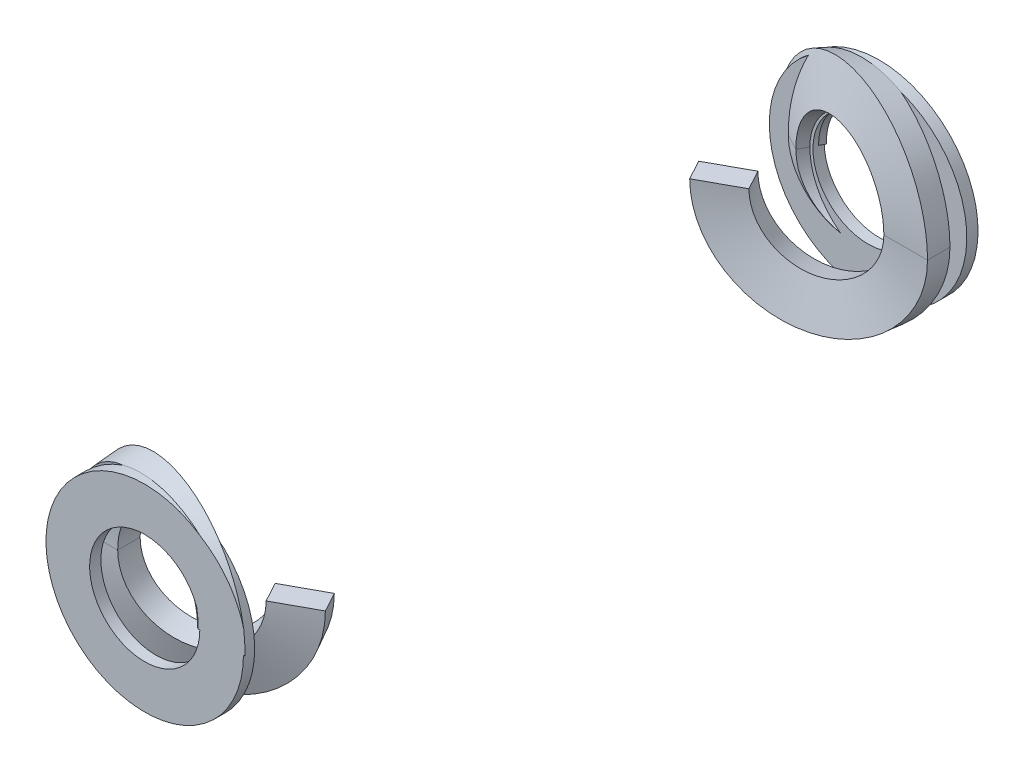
ISO-10303-21;
HEADER;
FILE_DESCRIPTION(('STEP AP214'),'2;1');
FILE_NAME('part.step','',(''),(''),'','','');
FILE_SCHEMA(('AUTOMOTIVE_DESIGN { 1 0 10303 214 1 1 1 1 }'));
ENDSEC;
DATA;
#1=APPLICATION_CONTEXT('core data for automotive mechanical design processes');
#2=APPLICATION_PROTOCOL_DEFINITION('international standard','automotive_design',2000,#1);
#3=PRODUCT_CONTEXT('',#1,'mechanical');
#4=PRODUCT('Part','Part','',(#3));
#5=PRODUCT_RELATED_PRODUCT_CATEGORY('part','',(#4));
#6=PRODUCT_DEFINITION_FORMATION('','',#4);
#7=PRODUCT_DEFINITION_CONTEXT('part definition',#1,'design');
#8=PRODUCT_DEFINITION('design','',#6,#7);
#9=PRODUCT_DEFINITION_SHAPE('','',#8);
#10=(LENGTH_UNIT() NAMED_UNIT(*) SI_UNIT(.MILLI.,.METRE.));
#11=(NAMED_UNIT(*) PLANE_ANGLE_UNIT() SI_UNIT($,.RADIAN.));
#12=(NAMED_UNIT(*) SI_UNIT($,.STERADIAN.) SOLID_ANGLE_UNIT());
#13=UNCERTAINTY_MEASURE_WITH_UNIT(LENGTH_MEASURE(1.E-05),#10,'distance_accuracy_value','');
#14=(GEOMETRIC_REPRESENTATION_CONTEXT(3) GLOBAL_UNCERTAINTY_ASSIGNED_CONTEXT((#13)) GLOBAL_UNIT_ASSIGNED_CONTEXT((#10,
#11,#12)) REPRESENTATION_CONTEXT('',''));
#15=CARTESIAN_POINT('',(0.,0.,0.));
#16=DIRECTION('',(0.,0.,1.));
#17=DIRECTION('',(1.,0.,0.));
#18=AXIS2_PLACEMENT_3D('',#15,#16,#17);
#19=CARTESIAN_POINT('',(-0.124156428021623,0.,-65.0236598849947));
#20=DIRECTION('',(-0.247461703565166,0.,0.968897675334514));
#21=DIRECTION('',(0.968897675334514,0.,0.247461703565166));
#22=AXIS2_PLACEMENT_3D('',#19,#20,#21);
#23=CONICAL_SURFACE('',#22,9.46736343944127,0.25005959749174);
#24=CARTESIAN_POINT('',(0.,0.,-66.665324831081));
#25=DIRECTION('',(-0.126673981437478,0.,0.991944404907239));
#26=DIRECTION('',(-0.991944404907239,0.,-0.126673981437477));
#27=AXIS2_PLACEMENT_3D('',#24,#25,#26);
#28=ELLIPSE('',#27,9.12223503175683,9.04875000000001);
#29=CARTESIAN_POINT('',(-5.04825000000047,7.50966367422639,-67.31));
#30=VERTEX_POINT('',#29);
#31=CARTESIAN_POINT('',(3.0071785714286,8.53444512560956,-66.2813));
#32=VERTEX_POINT('',#31);
#33=EDGE_CURVE('E260',#30,#32,#28,.F.);
#34=ORIENTED_EDGE('',*,*,#33,.F.);
#35=CARTESIAN_POINT('',(-0.139585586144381,0.,-67.31));
#36=DIRECTION('',(0.,0.,1.));
#37=DIRECTION('',(-1.,0.,0.));
#38=AXIS2_PLACEMENT_3D('',#35,#36,#37);
#39=ELLIPSE('',#38,9.18833558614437,8.88359570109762);
#40=CARTESIAN_POINT('',(-9.0759642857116,2.06609667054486,-67.31));
#41=VERTEX_POINT('',#40);
#42=EDGE_CURVE('E91',#30,#41,#39,.T.);
#43=ORIENTED_EDGE('',*,*,#42,.T.);
#44=CARTESIAN_POINT('',(-0.124156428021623,0.,-65.0236598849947));
#45=DIRECTION('',(0.247461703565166,0.,-0.968897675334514));
#46=DIRECTION('',(-0.968897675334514,0.,-0.247461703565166));
#47=AXIS2_PLACEMENT_3D('',#44,#45,#46);
#48=CIRCLE('',#47,9.46736343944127);
#49=CARTESIAN_POINT('',(9.04874999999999,0.,-62.68085));
#50=VERTEX_POINT('',#49);
#51=EDGE_CURVE('E233',#41,#50,#48,.T.);
#52=ORIENTED_EDGE('',*,*,#51,.T.);
#53=DIRECTION('',(0.,0.,-1.));
#54=VECTOR('',#53,1.);
#55=CARTESIAN_POINT('',(9.04874999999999,0.,-64.73825));
#56=LINE('',#55,#54);
#57=CARTESIAN_POINT('',(9.04874999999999,0.,-64.73825));
#58=VERTEX_POINT('',#57);
#59=EDGE_CURVE('E303',#50,#58,#56,.T.);
#60=ORIENTED_EDGE('',*,*,#59,.T.);
#61=CARTESIAN_POINT('',(0.369136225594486,0.,-66.9550702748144));
#62=DIRECTION('',(0.247461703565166,0.,-0.968897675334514));
#63=DIRECTION('',(-0.968897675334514,0.,-0.247461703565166));
#64=AXIS2_PLACEMENT_3D('',#61,#62,#63);
#65=CIRCLE('',#64,8.95823573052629);
#66=EDGE_CURVE('E223',#32,#58,#65,.T.);
#67=ORIENTED_EDGE('',*,*,#66,.F.);
#68=EDGE_LOOP('',(#34,#43,#52,#60,#67));
#69=FACE_BOUND('',#68,.T.);
#70=ADVANCED_FACE('F65',(#69),#23,.T.);
#71=CARTESIAN_POINT('',(-0.369136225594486,0.,-64.0644797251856));
#72=DIRECTION('',(0.247461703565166,0.,-0.968897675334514));
#73=DIRECTION('',(-0.968897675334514,0.,-0.247461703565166));
#74=AXIS2_PLACEMENT_3D('',#71,#72,#73);
#75=CONICAL_SURFACE('',#74,5.59128828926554,1.32073672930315);
#76=ORIENTED_EDGE('',*,*,#51,.F.);
#77=CARTESIAN_POINT('',(-5.52504413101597,11.532024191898,-67.31));
#78=CARTESIAN_POINT('',(-5.90253664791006,10.9387395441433,-67.31));
#79=CARTESIAN_POINT('',(-6.25962344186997,10.3317107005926,-67.31));
#80=CARTESIAN_POINT('',(-6.92522278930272,9.08948436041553,-67.31));
#81=CARTESIAN_POINT('',(-7.23359568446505,8.45421233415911,-67.31));
#82=CARTESIAN_POINT('',(-7.78199307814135,7.18089574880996,-67.31));
#83=CARTESIAN_POINT('',(-8.02403500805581,6.54372946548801,-67.31));
#84=CARTESIAN_POINT('',(-8.44504609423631,5.24946950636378,-67.31));
#85=CARTESIAN_POINT('',(-8.62409197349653,4.59240113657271,-67.31));
#86=CARTESIAN_POINT('',(-8.87314901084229,3.44322632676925,-67.31));
#87=CARTESIAN_POINT('',(-8.95955737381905,2.95464082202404,-67.31));
#88=CARTESIAN_POINT('',(-9.09309525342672,1.97206338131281,-67.31));
#89=CARTESIAN_POINT('',(-9.14022324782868,1.47807123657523,-67.31));
#90=CARTESIAN_POINT('',(-9.19461361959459,0.475012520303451,-67.31));
#91=CARTESIAN_POINT('',(-9.20081441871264,-0.0341137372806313,-67.31));
#92=CARTESIAN_POINT('',(-9.17799834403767,-0.796807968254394,-67.31));
#93=CARTESIAN_POINT('',(-9.16503121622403,-1.05095115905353,-67.31));
#94=CARTESIAN_POINT('',(-9.12849856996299,-1.5584732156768,-67.31));
#95=CARTESIAN_POINT('',(-9.10493313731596,-1.81185208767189,-67.31));
#96=CARTESIAN_POINT('',(-9.07612791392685,-2.06466075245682,-67.31));
#97=B_SPLINE_CURVE_WITH_KNOTS('',3,(#77,#78,#79,#80,#81,#82,#83,#84,#85,#86,#87,#88,#89,#90,#91,
#92,#93,#94,#95,#96),.UNSPECIFIED.,.F.,.F.,(4,2,2,2,2,2,2,2,2,4),(0.,2.11014514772,
4.22623419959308,6.26812457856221,8.30751945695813,9.79456003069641,11.2816582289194,
12.8071824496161,13.5704119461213,14.3336352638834),.UNSPECIFIED.);
#98=CARTESIAN_POINT('',(-9.19372491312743,0.,-67.31));
#99=VERTEX_POINT('',#98);
#100=EDGE_CURVE('E404',#41,#99,#97,.T.);
#101=ORIENTED_EDGE('',*,*,#100,.T.);
#102=DIRECTION('',(-0.877525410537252,0.,-0.479530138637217));
#103=VECTOR('',#102,1.);
#104=CARTESIAN_POINT('',(-9.29706285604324,0.,-67.3664697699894));
#105=LINE('',#104,#103);
#106=CARTESIAN_POINT('',(-9.04875,0.,-67.2307774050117));
#107=VERTEX_POINT('',#106);
#108=EDGE_CURVE('E211',#107,#99,#105,.T.);
#109=ORIENTED_EDGE('',*,*,#108,.F.);
#110=CARTESIAN_POINT('',(-0.767914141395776,9.01610694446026,-65.0750401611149));
#111=CARTESIAN_POINT('',(-1.02825027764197,8.99395662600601,-65.1406824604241));
#112=CARTESIAN_POINT('',(-1.2876323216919,8.96048531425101,-65.2062770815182));
#113=CARTESIAN_POINT('',(-1.80275721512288,8.87119993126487,-65.3369195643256));
#114=CARTESIAN_POINT('',(-2.05849881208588,8.81537835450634,-65.4019672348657));
#115=CARTESIAN_POINT('',(-2.56348010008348,8.6819590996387,-65.5307762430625));
#116=CARTESIAN_POINT('',(-2.81274067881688,8.60444436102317,-65.594541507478));
#117=CARTESIAN_POINT('',(-3.30386981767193,8.42807108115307,-65.7205317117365));
#118=CARTESIAN_POINT('',(-3.54574102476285,8.32922028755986,-65.7827572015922));
#119=CARTESIAN_POINT('',(-4.0799765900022,8.08334226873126,-65.9205716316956));
#120=CARTESIAN_POINT('',(-4.3698072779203,7.93044984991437,-65.995602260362));
#121=CARTESIAN_POINT('',(-4.9320834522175,7.59354239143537,-66.141630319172));
#122=CARTESIAN_POINT('',(-5.20452041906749,7.40951225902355,-66.2126257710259));
#123=CARTESIAN_POINT('',(-5.66889361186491,7.05748269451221,-66.3339997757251));
#124=CARTESIAN_POINT('',(-5.86504561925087,6.89535759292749,-66.385394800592));
#125=CARTESIAN_POINT('',(-6.24352412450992,6.55462549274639,-66.4847771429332));
#126=CARTESIAN_POINT('',(-6.42584728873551,6.3760145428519,-66.5327636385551));
#127=CARTESIAN_POINT('',(-6.7753288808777,6.00334141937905,-66.6249284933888));
#128=CARTESIAN_POINT('',(-6.94247512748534,5.80926706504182,-66.669103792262));
#129=CARTESIAN_POINT('',(-7.26018035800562,5.40697488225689,-66.7532214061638));
#130=CARTESIAN_POINT('',(-7.41073189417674,5.19875077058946,-66.7931618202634));
#131=CARTESIAN_POINT('',(-7.69347945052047,4.77031671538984,-66.8682919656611));
#132=CARTESIAN_POINT('',(-7.82573046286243,4.55014557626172,-66.9034959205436));
#133=CARTESIAN_POINT('',(-8.07124108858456,4.09888915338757,-66.9689370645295));
#134=CARTESIAN_POINT('',(-8.18450975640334,3.86780914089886,-66.999176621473));
#135=CARTESIAN_POINT('',(-8.39106538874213,3.39647436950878,-67.0543827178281));
#136=CARTESIAN_POINT('',(-8.48436730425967,3.15622663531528,-67.079353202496));
#137=CARTESIAN_POINT('',(-8.65023647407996,2.66827845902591,-67.1237835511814));
#138=CARTESIAN_POINT('',(-8.72280882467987,2.42057986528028,-67.1432447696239));
#139=CARTESIAN_POINT('',(-8.87218367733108,1.81581583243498,-67.1833256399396));
#140=CARTESIAN_POINT('',(-8.93833429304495,1.45586638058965,-67.2010987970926));
#141=CARTESIAN_POINT('',(-9.02660695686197,0.730544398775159,-67.224821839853));
#142=CARTESIAN_POINT('',(-9.04876062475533,0.365175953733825,-67.2307802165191));
#143=CARTESIAN_POINT('',(-9.04874049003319,-0.327095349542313,-67.2307748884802));
#144=CARTESIAN_POINT('',(-9.03098943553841,-0.653996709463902,-67.2260007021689));
#145=CARTESIAN_POINT('',(-8.97799050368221,-1.14119063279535,-67.2117560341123));
#146=CARTESIAN_POINT('',(-8.95591622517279,-1.30311941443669,-67.2058238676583));
#147=CARTESIAN_POINT('',(-8.90305781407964,-1.62545575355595,-67.191624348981));
#148=CARTESIAN_POINT('',(-8.87227317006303,-1.78586322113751,-67.1833568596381));
#149=CARTESIAN_POINT('',(-8.83717928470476,-1.94528631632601,-67.1739361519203));
#150=B_SPLINE_CURVE_WITH_KNOTS('',3,(#110,#111,#112,#113,#114,#115,#116,#117,#118,#119,#120,
#121,#122,#123,#124,#125,#126,#127,#128,#129,#130,#131,#132,#133,#134,#135,#136,#137,#138,#139,
#140,#141,#142,#143,#144,#145,#146,#147,#148,#149),.UNSPECIFIED.,.F.,.F.,(4,2,2,2,2,2,2,2,2,2,2,
2,2,2,2,2,2,2,2,4),(0.,0.807948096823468,1.61616774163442,2.42133857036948,3.2262175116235,
4.23277242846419,5.23981663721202,6.01780878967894,6.79598789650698,7.57478616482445,
8.35393254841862,9.13068428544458,9.90706445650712,10.68286122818,11.4584671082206,
12.5546813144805,13.6501074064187,14.6301655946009,15.1205444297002,15.6109520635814),.UNSPECIFIED.);
#151=CARTESIAN_POINT('',(-5.46726589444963,7.2103314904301,-66.2813));
#152=VERTEX_POINT('',#151);
#153=EDGE_CURVE('E370',#152,#107,#150,.T.);
#154=ORIENTED_EDGE('',*,*,#153,.F.);
#155=CARTESIAN_POINT('',(-7.16599885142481,-2.02356201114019,-66.2813));
#156=CARTESIAN_POINT('',(-7.19458755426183,-1.82443675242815,-66.2813));
#157=CARTESIAN_POINT('',(-7.21902779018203,-1.62473668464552,-66.2813));
#158=CARTESIAN_POINT('',(-7.25947562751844,-1.22448226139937,-66.2813));
#159=CARTESIAN_POINT('',(-7.27548310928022,-1.02392789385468,-66.2813));
#160=CARTESIAN_POINT('',(-7.31063801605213,-0.421671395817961,-66.2813));
#161=CARTESIAN_POINT('',(-7.31695188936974,-0.0191406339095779,-66.2813));
#162=CARTESIAN_POINT('',(-7.29524212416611,0.780403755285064,-66.2813));
#163=CARTESIAN_POINT('',(-7.26760355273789,1.17742854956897,-66.2813));
#164=CARTESIAN_POINT('',(-7.17943230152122,1.96779665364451,-66.2813));
#165=CARTESIAN_POINT('',(-7.11889964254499,2.36113996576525,-66.2813));
#166=CARTESIAN_POINT('',(-6.96620203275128,3.14351168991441,-66.2813));
#167=CARTESIAN_POINT('',(-6.87388989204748,3.5325111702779,-66.2813));
#168=CARTESIAN_POINT('',(-6.65995409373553,4.30237904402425,-66.2813));
#169=CARTESIAN_POINT('',(-6.53832584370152,4.68324615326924,-66.2813));
#170=CARTESIAN_POINT('',(-6.26776840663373,5.43712242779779,-66.2813));
#171=CARTESIAN_POINT('',(-6.11871363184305,5.81008626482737,-66.2813));
#172=CARTESIAN_POINT('',(-5.7964906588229,6.54537243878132,-66.2813));
#173=CARTESIAN_POINT('',(-5.62332366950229,6.90769530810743,-66.2813));
#174=CARTESIAN_POINT('',(-5.26507234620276,7.60289941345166,-66.2813));
#175=CARTESIAN_POINT('',(-5.08106010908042,7.93633616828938,-66.2813));
#176=CARTESIAN_POINT('',(-4.69594683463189,8.59321409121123,-66.2813));
#177=CARTESIAN_POINT('',(-4.49484373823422,8.91665404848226,-66.2813));
#178=CARTESIAN_POINT('',(-4.07929578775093,9.55097508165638,-66.2813));
#179=CARTESIAN_POINT('',(-3.86497541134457,9.86193806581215,-66.2813));
#180=CARTESIAN_POINT('',(-3.42331661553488,10.4742289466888,-66.2813));
#181=CARTESIAN_POINT('',(-3.19598548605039,10.7755620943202,-66.2813));
#182=CARTESIAN_POINT('',(-2.96293117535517,11.0723120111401,-66.2813));
#183=B_SPLINE_CURVE_WITH_KNOTS('',3,(#155,#156,#157,#158,#159,#160,#161,#162,#163,#164,#165,
#166,#167,#168,#169,#170,#171,#172,#173,#174,#175,#176,#177,#178,#179,#180,#181,#182),
.UNSPECIFIED.,.F.,.F.,(4,2,2,2,2,2,2,2,2,2,2,2,2,4),(0.,0.603413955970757,1.20683647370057,
2.41297079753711,3.6055513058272,4.79813105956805,5.99631038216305,7.19467752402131,
8.39867516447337,9.60261246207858,10.7445845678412,11.8866944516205,13.0193325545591,
14.151342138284),.UNSPECIFIED.);
#184=CARTESIAN_POINT('',(-7.31123554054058,0.,-66.2813));
#185=VERTEX_POINT('',#184);
#186=EDGE_CURVE('E332',#185,#152,#183,.T.);
#187=ORIENTED_EDGE('',*,*,#186,.F.);
#188=CARTESIAN_POINT('',(-5.78652245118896,0.,-65.4481094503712));
#189=VERTEX_POINT('',#188);
#190=EDGE_CURVE('E219',#189,#185,#105,.T.);
#191=ORIENTED_EDGE('',*,*,#190,.F.);
#192=CARTESIAN_POINT('',(-0.369136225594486,0.,-64.0644797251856));
#193=DIRECTION('',(0.247461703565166,0.,-0.968897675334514));
#194=DIRECTION('',(-0.968897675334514,0.,-0.247461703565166));
#195=AXIS2_PLACEMENT_3D('',#192,#193,#194);
#196=CIRCLE('',#195,5.59128828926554);
#197=CARTESIAN_POINT('',(5.04824999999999,0.,-62.68085));
#198=VERTEX_POINT('',#197);
#199=EDGE_CURVE('E229',#189,#198,#196,.T.);
#200=ORIENTED_EDGE('',*,*,#199,.T.);
#201=DIRECTION('',(1.,0.,0.));
#202=VECTOR('',#201,1.);
#203=CARTESIAN_POINT('',(9.04874999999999,0.,-62.68085));
#204=LINE('',#203,#202);
#205=EDGE_CURVE('E206',#198,#50,#204,.T.);
#206=ORIENTED_EDGE('',*,*,#205,.T.);
#207=EDGE_LOOP('',(#76,#101,#109,#154,#187,#191,#200,#206));
#208=FACE_BOUND('',#207,.T.);
#209=ADVANCED_FACE('F67',(#208),#75,.T.);
#210=CARTESIAN_POINT('',(0.124156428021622,0.,-65.9958901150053));
#211=DIRECTION('',(-0.247461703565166,0.,0.968897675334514));
#212=DIRECTION('',(0.968897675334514,0.,0.247461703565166));
#213=AXIS2_PLACEMENT_3D('',#210,#211,#212);
#214=CONICAL_SURFACE('',#213,5.08216058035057,0.25005959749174);
#215=CARTESIAN_POINT('',(-0.14148470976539,0.,-66.2813));
#216=DIRECTION('',(0.,0.,-1.));
#217=DIRECTION('',(-1.,0.,0.));
#218=AXIS2_PLACEMENT_3D('',#215,#216,#217);
#219=ELLIPSE('',#218,5.18973470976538,5.0176122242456);
#220=CARTESIAN_POINT('',(-0.99332142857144,4.94955963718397,-66.2813));
#221=VERTEX_POINT('',#220);
#222=CARTESIAN_POINT('',(-5.33121941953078,0.,-66.2813));
#223=VERTEX_POINT('',#222);
#224=EDGE_CURVE('E343',#221,#223,#219,.F.);
#225=ORIENTED_EDGE('',*,*,#224,.F.);
#226=CARTESIAN_POINT('',(0.124156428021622,0.,-65.9958901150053));
#227=DIRECTION('',(0.247461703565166,0.,-0.968897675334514));
#228=DIRECTION('',(-0.968897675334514,0.,-0.247461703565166));
#229=AXIS2_PLACEMENT_3D('',#226,#227,#228);
#230=CIRCLE('',#229,5.08216058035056);
#231=CARTESIAN_POINT('',(5.04824999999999,0.,-64.73825));
#232=VERTEX_POINT('',#231);
#233=EDGE_CURVE('E226',#221,#232,#230,.T.);
#234=ORIENTED_EDGE('',*,*,#233,.T.);
#235=DIRECTION('',(0.,0.,1.));
#236=VECTOR('',#235,1.);
#237=CARTESIAN_POINT('',(5.04824999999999,0.,-64.73825));
#238=LINE('',#237,#236);
#239=EDGE_CURVE('E215',#232,#198,#238,.T.);
#240=ORIENTED_EDGE('',*,*,#239,.T.);
#241=ORIENTED_EDGE('',*,*,#199,.F.);
#242=DIRECTION('',(0.479530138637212,0.,-0.877525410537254));
#243=VECTOR('',#242,1.);
#244=CARTESIAN_POINT('',(-5.33121941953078,0.,-66.2813));
#245=LINE('',#244,#243);
#246=EDGE_CURVE('E251',#189,#223,#245,.T.);
#247=ORIENTED_EDGE('',*,*,#246,.T.);
#248=EDGE_LOOP('',(#225,#234,#240,#241,#247));
#249=FACE_BOUND('',#248,.T.);
#250=ADVANCED_FACE('F318',(#249),#214,.F.);
#251=CARTESIAN_POINT('',(0.369136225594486,0.,-66.9550702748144));
#252=DIRECTION('',(0.247461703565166,0.,-0.968897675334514));
#253=DIRECTION('',(-0.968897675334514,0.,-0.247461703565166));
#254=AXIS2_PLACEMENT_3D('',#251,#252,#253);
#255=CONICAL_SURFACE('',#254,8.95823573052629,1.32073672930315);
#256=CARTESIAN_POINT('',(6.83335840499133,10.9118756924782,-66.2813));
#257=CARTESIAN_POINT('',(6.58209162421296,10.7727481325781,-66.2813));
#258=CARTESIAN_POINT('',(6.33194678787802,10.6316003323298,-66.2813));
#259=CARTESIAN_POINT('',(5.83417501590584,10.3448702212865,-66.2813));
#260=CARTESIAN_POINT('',(5.58654837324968,10.1992874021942,-66.2813));
#261=CARTESIAN_POINT('',(4.84685221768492,9.75468812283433,-66.2813));
#262=CARTESIAN_POINT('',(4.3590827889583,9.44843404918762,-66.2813));
#263=CARTESIAN_POINT('',(3.39091054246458,8.80782303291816,-66.2813));
#264=CARTESIAN_POINT('',(2.91075417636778,8.47309190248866,-66.2813));
#265=CARTESIAN_POINT('',(1.97205986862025,7.77504091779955,-66.2813));
#266=CARTESIAN_POINT('',(1.51350124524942,7.41174934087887,-66.2813));
#267=CARTESIAN_POINT('',(0.839838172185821,6.83281952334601,-66.2813));
#268=CARTESIAN_POINT('',(0.613616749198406,6.6301011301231,-66.2813));
#269=CARTESIAN_POINT('',(0.171186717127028,6.21389070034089,-66.2813));
#270=CARTESIAN_POINT('',(-0.0450205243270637,6.0003972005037,-66.2813));
#271=CARTESIAN_POINT('',(-0.464555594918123,5.56194596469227,-66.2813));
#272=CARTESIAN_POINT('',(-0.667910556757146,5.3370143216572,-66.2813));
#273=CARTESIAN_POINT('',(-1.05914443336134,4.87405011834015,-66.2813));
#274=CARTESIAN_POINT('',(-1.24702768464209,4.63602126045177,-66.2813));
#275=CARTESIAN_POINT('',(-1.55890299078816,4.20689526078,-66.2813));
#276=CARTESIAN_POINT('',(-1.68714585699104,4.01889220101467,-66.2813));
#277=CARTESIAN_POINT('',(-1.93061323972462,3.63450843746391,-66.2813));
#278=CARTESIAN_POINT('',(-2.04583446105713,3.43812563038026,-66.2813));
#279=CARTESIAN_POINT('',(-2.26055750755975,3.03743170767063,-66.2813));
#280=CARTESIAN_POINT('',(-2.36009235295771,2.83313840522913,-66.2813));
#281=CARTESIAN_POINT('',(-2.54099276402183,2.41674903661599,-66.2813));
#282=CARTESIAN_POINT('',(-2.62237189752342,2.2046589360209,-66.2813));
#283=CARTESIAN_POINT('',(-2.74861946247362,1.82121821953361,-66.2813));
#284=CARTESIAN_POINT('',(-2.79758202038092,1.65121329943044,-66.2813));
#285=CARTESIAN_POINT('',(-2.88165906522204,1.30787078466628,-66.2813));
#286=CARTESIAN_POINT('',(-2.91678044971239,1.13453489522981,-66.2813));
#287=CARTESIAN_POINT('',(-2.9722517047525,0.785441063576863,-66.2813));
#288=CARTESIAN_POINT('',(-2.99259653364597,0.609682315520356,-66.2813));
#289=CARTESIAN_POINT('',(-3.0178878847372,0.257068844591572,-66.2813));
#290=CARTESIAN_POINT('',(-3.02283642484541,0.080214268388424,-66.2813));
#291=CARTESIAN_POINT('',(-3.01750261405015,-0.253862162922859,-66.2813));
#292=CARTESIAN_POINT('',(-3.00882953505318,-0.411112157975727,-66.2813));
#293=CARTESIAN_POINT('',(-2.97937850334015,-0.724491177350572,-66.2813));
#294=CARTESIAN_POINT('',(-2.95859922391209,-0.880620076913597,-66.2813));
#295=CARTESIAN_POINT('',(-2.90534501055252,-1.19123647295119,-66.2813));
#296=CARTESIAN_POINT('',(-2.87284217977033,-1.34571914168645,-66.2813));
#297=CARTESIAN_POINT('',(-2.79689724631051,-1.65191298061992,-66.2813));
#298=CARTESIAN_POINT('',(-2.75345951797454,-1.80362523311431,-66.2813));
#299=CARTESIAN_POINT('',(-2.70491515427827,-1.953639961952,-66.2813));
#300=B_SPLINE_CURVE_WITH_KNOTS('',3,(#256,#257,#258,#259,#260,#261,#262,#263,#264,#265,#266,
#267,#268,#269,#270,#271,#272,#273,#274,#275,#276,#277,#278,#279,#280,#281,#282,#283,#284,#285,
#286,#287,#288,#289,#290,#291,#292,#293,#294,#295,#296,#297,#298,#299),.UNSPECIFIED.,.F.,.F.,(4,
2,2,2,2,2,2,2,2,2,2,2,2,2,2,2,2,2,2,2,2,4),(0.,0.861620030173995,1.72333918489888,
3.45059614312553,5.20576769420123,6.95922284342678,7.8702261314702,8.78135346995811,
9.6904882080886,10.5993672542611,11.281655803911,11.9641166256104,12.645121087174,
13.3256149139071,13.8558425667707,14.3858056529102,14.9159494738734,15.4460238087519,
15.9180241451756,16.3900762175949,16.8632590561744,17.3362529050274),.UNSPECIFIED.);
#301=EDGE_CURVE('E346',#32,#221,#300,.T.);
#302=ORIENTED_EDGE('',*,*,#301,.F.);
#303=ORIENTED_EDGE('',*,*,#66,.T.);
#304=DIRECTION('',(-1.,0.,0.));
#305=VECTOR('',#304,1.);
#306=CARTESIAN_POINT('',(9.04874999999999,0.,-64.73825));
#307=LINE('',#306,#305);
#308=EDGE_CURVE('E307',#58,#232,#307,.T.);
#309=ORIENTED_EDGE('',*,*,#308,.T.);
#310=ORIENTED_EDGE('',*,*,#233,.F.);
#311=EDGE_LOOP('',(#302,#303,#309,#310));
#312=FACE_BOUND('',#311,.T.);
#313=ADVANCED_FACE('F350',(#312),#255,.F.);
#314=CARTESIAN_POINT('',(-9.29706285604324,0.,-67.3664697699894));
#315=DIRECTION('',(0.,1.,0.));
#316=DIRECTION('',(0.479530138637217,0.,-0.877525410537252));
#317=AXIS2_PLACEMENT_3D('',#314,#315,#316);
#318=PLANE('',#317);
#319=ORIENTED_EDGE('',*,*,#108,.T.);
#320=DIRECTION('',(1.,0.,0.));
#321=VECTOR('',#320,1.);
#322=CARTESIAN_POINT('',(-9.29706285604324,0.,-67.31));
#323=LINE('',#322,#321);
#324=CARTESIAN_POINT('',(-9.04875000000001,0.,-67.31));
#325=VERTEX_POINT('',#324);
#326=EDGE_CURVE('E411',#99,#325,#323,.T.);
#327=ORIENTED_EDGE('',*,*,#326,.T.);
#328=DIRECTION('',(0.,0.,1.));
#329=VECTOR('',#328,1.);
#330=CARTESIAN_POINT('',(-9.04875000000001,0.,0.));
#331=LINE('',#330,#329);
#332=EDGE_CURVE('E236',#107,#325,#331,.F.);
#333=ORIENTED_EDGE('',*,*,#332,.F.);
#334=EDGE_LOOP('',(#319,#327,#333));
#335=FACE_BOUND('',#334,.T.);
#336=ADVANCED_FACE('F478',(#335),#318,.F.);
#337=CARTESIAN_POINT('',(-0.20107395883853,0.,-68.0972737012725));
#338=DIRECTION('',(-0.247461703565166,0.,-0.968897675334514));
#339=DIRECTION('',(-0.968897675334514,0.,0.247461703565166));
#340=AXIS2_PLACEMENT_3D('',#337,#338,#339);
#341=CONICAL_SURFACE('',#340,7.33840297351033,0.820617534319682);
#342=ORIENTED_EDGE('',*,*,#190,.T.);
#343=CARTESIAN_POINT('',(-1.36648596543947,0.,-66.2813));
#344=DIRECTION('',(0.,0.,-1.));
#345=DIRECTION('',(-1.,0.,0.));
#346=AXIS2_PLACEMENT_3D('',#343,#344,#345);
#347=ELLIPSE('',#346,5.94474957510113,5.53932323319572);
#348=CARTESIAN_POINT('',(-2.52429490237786,-5.4332485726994,-66.2813));
#349=VERTEX_POINT('',#348);
#350=EDGE_CURVE('E336',#185,#349,#347,.F.);
#351=ORIENTED_EDGE('',*,*,#350,.T.);
#352=CARTESIAN_POINT('',(0.092065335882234,0.,-66.9495325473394));
#353=DIRECTION('',(-0.247461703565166,0.,-0.968897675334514));
#354=DIRECTION('',(-0.968897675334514,0.,0.247461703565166));
#355=AXIS2_PLACEMENT_3D('',#352,#353,#354);
#356=CIRCLE('',#355,6.06729475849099);
#357=EDGE_CURVE('E258',#349,#189,#356,.T.);
#358=ORIENTED_EDGE('',*,*,#357,.T.);
#359=EDGE_LOOP('',(#342,#351,#358));
#360=FACE_BOUND('',#359,.T.);
#361=ADVANCED_FACE('F335',(#360),#341,.T.);
#362=CARTESIAN_POINT('',(0.092065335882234,0.,-66.9495325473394));
#363=DIRECTION('',(0.247461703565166,0.,0.968897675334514));
#364=DIRECTION('',(0.968897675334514,0.,-0.247461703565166));
#365=AXIS2_PLACEMENT_3D('',#362,#363,#364);
#366=CONICAL_SURFACE('',#365,6.06729475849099,0.750178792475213);
#367=ORIENTED_EDGE('',*,*,#357,.F.);
#368=CARTESIAN_POINT('',(2.01012229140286,0.,-66.2813));
#369=DIRECTION('',(0.,0.,-1.));
#370=DIRECTION('',(1.,0.,0.));
#371=AXIS2_PLACEMENT_3D('',#368,#369,#370);
#372=ELLIPSE('',#371,7.34134171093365,6.90858270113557);
#373=EDGE_CURVE('E342',#349,#223,#372,.T.);
#374=ORIENTED_EDGE('',*,*,#373,.T.);
#375=ORIENTED_EDGE('',*,*,#246,.F.);
#376=EDGE_LOOP('',(#367,#374,#375));
#377=FACE_BOUND('',#376,.T.);
#378=ADVANCED_FACE('F341',(#377),#366,.F.);
#379=CARTESIAN_POINT('',(-0.12415642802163,0.,-62.3954401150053));
#380=DIRECTION('',(0.247461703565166,0.,0.968897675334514));
#381=DIRECTION('',(0.968897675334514,0.,-0.247461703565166));
#382=AXIS2_PLACEMENT_3D('',#379,#380,#381);
#383=CONICAL_SURFACE('',#382,9.46736343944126,1.32073672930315);
#384=CARTESIAN_POINT('',(-0.12415642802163,0.,-62.3954401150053));
#385=DIRECTION('',(0.247461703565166,0.,0.968897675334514));
#386=DIRECTION('',(0.968897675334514,0.,-0.247461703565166));
#387=AXIS2_PLACEMENT_3D('',#384,#385,#386);
#388=CIRCLE('',#387,9.46736343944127);
#389=CARTESIAN_POINT('',(-9.29706285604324,0.,-60.0526302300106));
#390=VERTEX_POINT('',#389);
#391=EDGE_CURVE('E299',#390,#58,#388,.T.);
#392=ORIENTED_EDGE('',*,*,#391,.F.);
#393=DIRECTION('',(0.877525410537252,0.,-0.479530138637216));
#394=VECTOR('',#393,1.);
#395=CARTESIAN_POINT('',(-9.29706285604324,0.,-60.0526302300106));
#396=LINE('',#395,#394);
#397=CARTESIAN_POINT('',(-5.78652245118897,0.,-61.9709905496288));
#398=VERTEX_POINT('',#397);
#399=EDGE_CURVE('E271',#390,#398,#396,.T.);
#400=ORIENTED_EDGE('',*,*,#399,.T.);
#401=CARTESIAN_POINT('',(-0.369136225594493,0.,-63.3546202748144));
#402=DIRECTION('',(0.247461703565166,0.,0.968897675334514));
#403=DIRECTION('',(0.968897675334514,0.,-0.247461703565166));
#404=AXIS2_PLACEMENT_3D('',#401,#402,#403);
#405=CIRCLE('',#404,5.59128828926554);
#406=EDGE_CURVE('E287',#398,#232,#405,.T.);
#407=ORIENTED_EDGE('',*,*,#406,.T.);
#408=ORIENTED_EDGE('',*,*,#308,.F.);
#409=EDGE_LOOP('',(#392,#400,#407,#408));
#410=FACE_BOUND('',#409,.T.);
#411=ADVANCED_FACE('F516',(#410),#383,.T.);
#412=CARTESIAN_POINT('',(0.369136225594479,0.,-60.4640297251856));
#413=DIRECTION('',(-0.247461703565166,0.,-0.968897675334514));
#414=DIRECTION('',(-0.968897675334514,0.,0.247461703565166));
#415=AXIS2_PLACEMENT_3D('',#412,#413,#414);
#416=CONICAL_SURFACE('',#415,8.95823573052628,0.250059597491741);
#417=CARTESIAN_POINT('',(0.369136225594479,0.,-60.4640297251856));
#418=DIRECTION('',(0.247461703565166,0.,0.968897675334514));
#419=DIRECTION('',(0.968897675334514,0.,-0.247461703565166));
#420=AXIS2_PLACEMENT_3D('',#417,#418,#419);
#421=CIRCLE('',#420,8.95823573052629);
#422=CARTESIAN_POINT('',(-8.31047754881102,0.,-58.2472094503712));
#423=VERTEX_POINT('',#422);
#424=EDGE_CURVE('E295',#423,#50,#421,.T.);
#425=ORIENTED_EDGE('',*,*,#424,.F.);
#426=DIRECTION('',(-0.479530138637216,0.,-0.877525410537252));
#427=VECTOR('',#426,1.);
#428=CARTESIAN_POINT('',(-8.31047754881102,0.,-58.2472094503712));
#429=LINE('',#428,#427);
#430=EDGE_CURVE('E283',#423,#390,#429,.T.);
#431=ORIENTED_EDGE('',*,*,#430,.T.);
#432=ORIENTED_EDGE('',*,*,#391,.T.);
#433=ORIENTED_EDGE('',*,*,#59,.F.);
#434=EDGE_LOOP('',(#425,#431,#432,#433));
#435=FACE_BOUND('',#434,.T.);
#436=ADVANCED_FACE('F512',(#435),#416,.T.);
#437=CARTESIAN_POINT('',(0.124156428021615,0.,-61.4232098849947));
#438=DIRECTION('',(0.247461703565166,0.,0.968897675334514));
#439=DIRECTION('',(0.968897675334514,0.,-0.247461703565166));
#440=AXIS2_PLACEMENT_3D('',#437,#438,#439);
#441=CONICAL_SURFACE('',#440,5.08216058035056,1.32073672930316);
#442=CARTESIAN_POINT('',(0.124156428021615,0.,-61.4232098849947));
#443=DIRECTION('',(0.247461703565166,0.,0.968897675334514));
#444=DIRECTION('',(0.968897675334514,0.,-0.247461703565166));
#445=AXIS2_PLACEMENT_3D('',#442,#443,#444);
#446=CIRCLE('',#445,5.08216058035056);
#447=CARTESIAN_POINT('',(-4.79993714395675,0.,-60.1655697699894));
#448=VERTEX_POINT('',#447);
#449=EDGE_CURVE('E291',#448,#198,#446,.T.);
#450=ORIENTED_EDGE('',*,*,#449,.F.);
#451=DIRECTION('',(-0.877525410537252,0.,0.479530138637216));
#452=VECTOR('',#451,1.);
#453=CARTESIAN_POINT('',(-4.79993714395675,0.,-60.1655697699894));
#454=LINE('',#453,#452);
#455=EDGE_CURVE('E279',#448,#423,#454,.T.);
#456=ORIENTED_EDGE('',*,*,#455,.T.);
#457=ORIENTED_EDGE('',*,*,#424,.T.);
#458=ORIENTED_EDGE('',*,*,#205,.F.);
#459=EDGE_LOOP('',(#450,#456,#457,#458));
#460=FACE_BOUND('',#459,.T.);
#461=ADVANCED_FACE('F323',(#460),#441,.F.);
#462=CARTESIAN_POINT('',(-0.369136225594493,0.,-63.3546202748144));
#463=DIRECTION('',(-0.247461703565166,0.,-0.968897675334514));
#464=DIRECTION('',(-0.968897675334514,0.,0.247461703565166));
#465=AXIS2_PLACEMENT_3D('',#462,#463,#464);
#466=CONICAL_SURFACE('',#465,5.59128828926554,0.25005959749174);
#467=DIRECTION('',(0.479530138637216,0.,0.877525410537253));
#468=VECTOR('',#467,1.);
#469=CARTESIAN_POINT('',(-5.78652245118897,0.,-61.9709905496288));
#470=LINE('',#469,#468);
#471=EDGE_CURVE('E275',#398,#448,#470,.T.);
#472=ORIENTED_EDGE('',*,*,#471,.T.);
#473=ORIENTED_EDGE('',*,*,#449,.T.);
#474=ORIENTED_EDGE('',*,*,#239,.F.);
#475=ORIENTED_EDGE('',*,*,#406,.F.);
#476=EDGE_LOOP('',(#472,#473,#474,#475));
#477=FACE_BOUND('',#476,.T.);
#478=ADVANCED_FACE('F327',(#477),#466,.F.);
#479=CARTESIAN_POINT('',(-9.29706285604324,0.,-60.0526302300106));
#480=DIRECTION('',(0.,1.,0.));
#481=DIRECTION('',(-0.479530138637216,0.,-0.877525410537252));
#482=AXIS2_PLACEMENT_3D('',#479,#480,#481);
#483=PLANE('',#482);
#484=ORIENTED_EDGE('',*,*,#399,.F.);
#485=ORIENTED_EDGE('',*,*,#430,.F.);
#486=ORIENTED_EDGE('',*,*,#455,.F.);
#487=ORIENTED_EDGE('',*,*,#471,.F.);
#488=EDGE_LOOP('',(#484,#485,#486,#487));
#489=FACE_BOUND('',#488,.T.);
#490=ADVANCED_FACE('F518',(#489),#483,.T.);
#491=CARTESIAN_POINT('',(0.,0.,0.));
#492=DIRECTION('',(0.,0.,1.));
#493=DIRECTION('',(1.,0.,0.));
#494=AXIS2_PLACEMENT_3D('',#491,#492,#493);
#495=CYLINDRICAL_SURFACE('',#494,5.04825);
#496=CARTESIAN_POINT('',(-0.992568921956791,4.94971059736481,-66.2811));
#497=CARTESIAN_POINT('',(-1.13547402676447,4.92106687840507,-66.3190797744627));
#498=CARTESIAN_POINT('',(-1.27718728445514,4.88619888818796,-66.3568562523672));
#499=CARTESIAN_POINT('',(-1.55724328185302,4.80427662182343,-66.4317226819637));
#500=CARTESIAN_POINT('',(-1.69558579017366,4.75722151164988,-66.4688125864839));
#501=CARTESIAN_POINT('',(-1.96802527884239,4.65113999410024,-66.5420560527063));
#502=CARTESIAN_POINT('',(-2.10211802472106,4.59210205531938,-66.5782086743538));
#503=CARTESIAN_POINT('',(-2.36492655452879,4.46244514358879,-66.6492516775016));
#504=CARTESIAN_POINT('',(-2.49364255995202,4.39182664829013,-66.6841421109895));
#505=CARTESIAN_POINT('',(-2.74444440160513,4.23961340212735,-66.752296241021));
#506=CARTESIAN_POINT('',(-2.86654471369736,4.15804409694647,-66.7855634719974));
#507=CARTESIAN_POINT('',(-3.10353076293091,3.9842842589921,-66.8502835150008));
#508=CARTESIAN_POINT('',(-3.21841372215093,3.89208967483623,-66.8817356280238));
#509=CARTESIAN_POINT('',(-3.43985711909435,3.6978208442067,-66.9424926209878));
#510=CARTESIAN_POINT('',(-3.5464274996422,3.59575873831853,-66.9718000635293));
#511=CARTESIAN_POINT('',(-3.75056260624,3.38229597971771,-67.0280488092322));
#512=CARTESIAN_POINT('',(-3.84812324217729,3.27089112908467,-67.0549890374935));
#513=CARTESIAN_POINT('',(-4.03073688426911,3.04281559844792,-67.1055043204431));
#514=CARTESIAN_POINT('',(-4.11606430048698,2.92638082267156,-67.129152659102));
#515=CARTESIAN_POINT('',(-4.27660270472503,2.68632376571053,-67.1737123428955));
#516=CARTESIAN_POINT('',(-4.35181887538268,2.56270521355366,-67.1946250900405));
#517=CARTESIAN_POINT('',(-4.49156291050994,2.30904096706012,-67.2335285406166));
#518=CARTESIAN_POINT('',(-4.55608517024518,2.17899194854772,-67.2515177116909));
#519=CARTESIAN_POINT('',(-4.67378414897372,1.91354083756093,-67.284367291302));
#520=CARTESIAN_POINT('',(-4.72696580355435,1.77814110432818,-67.2992290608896));
#521=CARTESIAN_POINT('',(-4.81934627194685,1.50930208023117,-67.3250660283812));
#522=CARTESIAN_POINT('',(-4.85907568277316,1.37605902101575,-67.3361885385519));
#523=CARTESIAN_POINT('',(-4.92744556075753,1.10654328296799,-67.3553399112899));
#524=CARTESIAN_POINT('',(-4.95608655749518,0.970270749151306,-67.3633689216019));
#525=CARTESIAN_POINT('',(-5.00205251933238,0.69549585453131,-67.3762588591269));
#526=CARTESIAN_POINT('',(-5.01936244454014,0.556990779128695,-67.381115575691));
#527=CARTESIAN_POINT('',(-5.04247418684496,0.278925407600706,-67.3876014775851));
#528=CARTESIAN_POINT('',(-5.04827401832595,0.13936493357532,-67.3892301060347));
#529=CARTESIAN_POINT('',(-5.04824999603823,-0.000200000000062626,-67.3892225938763));
#530=B_SPLINE_CURVE_WITH_KNOTS('',3,(#496,#497,#498,#499,#500,#501,#502,#503,#504,#505,#506,
#507,#508,#509,#510,#511,#512,#513,#514,#515,#516,#517,#518,#519,#520,#521,#522,#523,#524,#525,
#526,#527,#528,#529),.UNSPECIFIED.,.F.,.F.,(4,2,2,2,2,2,2,2,2,2,2,2,2,2,2,2,4),(0.,
0.451714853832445,0.903460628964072,1.35564321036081,1.80780714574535,2.25893803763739,
2.71024151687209,3.1609966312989,3.61195537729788,4.05024343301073,4.48830597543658,
4.92659738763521,5.36469765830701,5.78264923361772,6.20058084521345,6.61906606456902,
7.03762347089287),.UNSPECIFIED.);
#531=CARTESIAN_POINT('',(-4.7654769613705,1.66585035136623,-67.31));
#532=VERTEX_POINT('',#531);
#533=EDGE_CURVE('E252',#221,#532,#530,.T.);
#534=ORIENTED_EDGE('',*,*,#533,.T.);
#535=CARTESIAN_POINT('',(0.,0.,-67.31));
#536=DIRECTION('',(0.,0.,1.));
#537=DIRECTION('',(1.,0.,0.));
#538=AXIS2_PLACEMENT_3D('',#535,#536,#537);
#539=CIRCLE('',#538,5.04825);
#540=CARTESIAN_POINT('',(-5.04825,0.,-67.31));
#541=VERTEX_POINT('',#540);
#542=EDGE_CURVE('E102',#532,#541,#539,.F.);
#543=ORIENTED_EDGE('',*,*,#542,.T.);
#544=DIRECTION('',(0.,0.,1.));
#545=VECTOR('',#544,1.);
#546=CARTESIAN_POINT('',(-5.04825,0.,0.));
#547=LINE('',#546,#545);
#548=CARTESIAN_POINT('',(-5.04825,0.,-66.7991253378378));
#549=VERTEX_POINT('',#548);
#550=EDGE_CURVE('E81',#541,#549,#547,.T.);
#551=ORIENTED_EDGE('',*,*,#550,.T.);
#552=CARTESIAN_POINT('',(0.,0.,-66.154450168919));
#553=DIRECTION('',(-0.126673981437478,0.,0.991944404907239));
#554=DIRECTION('',(-0.991944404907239,0.,-0.126673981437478));
#555=AXIS2_PLACEMENT_3D('',#552,#553,#554);
#556=ELLIPSE('',#555,5.08924691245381,5.04825);
#557=EDGE_CURVE('E246',#549,#221,#556,.F.);
#558=ORIENTED_EDGE('',*,*,#557,.T.);
#559=CARTESIAN_POINT('',(0.,0.,-66.2813));
#560=DIRECTION('',(0.,0.,1.));
#561=DIRECTION('',(1.,0.,0.));
#562=AXIS2_PLACEMENT_3D('',#559,#560,#561);
#563=CIRCLE('',#562,5.04825);
#564=EDGE_CURVE('E389',#221,#221,#563,.T.);
#565=ORIENTED_EDGE('',*,*,#564,.T.);
#566=EDGE_LOOP('',(#534,#543,#551,#558,#565));
#567=FACE_BOUND('',#566,.T.);
#568=ADVANCED_FACE('F243',(#567),#495,.F.);
#569=CARTESIAN_POINT('',(0.,0.,0.));
#570=DIRECTION('',(0.,0.,1.));
#571=DIRECTION('',(1.,0.,0.));
#572=AXIS2_PLACEMENT_3D('',#569,#570,#571);
#573=CYLINDRICAL_SURFACE('',#572,9.04875000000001);
#574=ORIENTED_EDGE('',*,*,#332,.T.);
#575=CARTESIAN_POINT('',(0.,0.,-67.31));
#576=DIRECTION('',(0.,0.,1.));
#577=DIRECTION('',(1.,0.,0.));
#578=AXIS2_PLACEMENT_3D('',#575,#576,#577);
#579=CIRCLE('',#578,9.04875000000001);
#580=EDGE_CURVE('E417',#325,#30,#579,.T.);
#581=ORIENTED_EDGE('',*,*,#580,.T.);
#582=ORIENTED_EDGE('',*,*,#33,.T.);
#583=CARTESIAN_POINT('',(0.,0.,-66.2813));
#584=DIRECTION('',(0.,0.,1.));
#585=DIRECTION('',(1.,0.,0.));
#586=AXIS2_PLACEMENT_3D('',#583,#584,#585);
#587=CIRCLE('',#586,9.04875000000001);
#588=EDGE_CURVE('E394',#152,#32,#587,.T.);
#589=ORIENTED_EDGE('',*,*,#588,.F.);
#590=ORIENTED_EDGE('',*,*,#153,.T.);
#591=EDGE_LOOP('',(#574,#581,#582,#589,#590));
#592=FACE_BOUND('',#591,.T.);
#593=ADVANCED_FACE('F435',(#592),#573,.T.);
#594=CARTESIAN_POINT('',(-9.04875000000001,0.,-66.2813));
#595=DIRECTION('',(0.,0.,-1.));
#596=DIRECTION('',(-1.,0.,0.));
#597=AXIS2_PLACEMENT_3D('',#594,#595,#596);
#598=PLANE('',#597);
#599=ORIENTED_EDGE('',*,*,#350,.F.);
#600=ORIENTED_EDGE('',*,*,#186,.T.);
#601=ORIENTED_EDGE('',*,*,#588,.T.);
#602=ORIENTED_EDGE('',*,*,#301,.T.);
#603=ORIENTED_EDGE('',*,*,#564,.F.);
#604=ORIENTED_EDGE('',*,*,#224,.T.);
#605=ORIENTED_EDGE('',*,*,#373,.F.);
#606=EDGE_LOOP('',(#599,#600,#601,#602,#603,#604,#605));
#607=FACE_BOUND('',#606,.T.);
#608=ADVANCED_FACE('F440',(#607),#598,.F.);
#609=ORIENTED_EDGE('',*,*,#550,.F.);
#610=DIRECTION('',(1.,0.,0.));
#611=VECTOR('',#610,1.);
#612=CARTESIAN_POINT('',(-9.29706285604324,0.,-67.31));
#613=LINE('',#612,#611);
#614=CARTESIAN_POINT('',(-4.90327508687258,-1.35328670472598E-11,-67.31));
#615=VERTEX_POINT('',#614);
#616=EDGE_CURVE('E188',#541,#615,#613,.T.);
#617=ORIENTED_EDGE('',*,*,#616,.T.);
#618=DIRECTION('',(0.877525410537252,0.,0.479530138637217));
#619=VECTOR('',#618,1.);
#620=CARTESIAN_POINT('',(-8.31047754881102,0.,-69.1718905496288));
#621=LINE('',#620,#619);
#622=CARTESIAN_POINT('',(-4.79993714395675,0.,-67.2535302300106));
#623=VERTEX_POINT('',#622);
#624=EDGE_CURVE('E197',#615,#623,#621,.T.);
#625=ORIENTED_EDGE('',*,*,#624,.T.);
#626=DIRECTION('',(-0.479530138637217,0.,0.877525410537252));
#627=VECTOR('',#626,1.);
#628=CARTESIAN_POINT('',(-4.79993714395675,0.,-67.2535302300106));
#629=LINE('',#628,#627);
#630=EDGE_CURVE('E205',#623,#549,#629,.T.);
#631=ORIENTED_EDGE('',*,*,#630,.T.);
#632=EDGE_LOOP('',(#609,#617,#625,#631));
#633=FACE_BOUND('',#632,.T.);
#634=ADVANCED_FACE('F195',(#633),#318,.F.);
#635=ORIENTED_EDGE('',*,*,#624,.F.);
#636=CARTESIAN_POINT('',(-4.88162534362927,-0.660299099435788,-67.31));
#637=CARTESIAN_POINT('',(-4.89113982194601,-0.515275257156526,-67.31));
#638=CARTESIAN_POINT('',(-4.89752345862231,-0.370063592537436,-67.31));
#639=CARTESIAN_POINT('',(-4.90400872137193,-0.0795033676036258,-67.31));
#640=CARTESIAN_POINT('',(-4.90411048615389,0.0658451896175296,-67.31));
#641=CARTESIAN_POINT('',(-4.89496807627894,0.501501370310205,-67.31));
#642=CARTESIAN_POINT('',(-4.87629238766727,0.79166617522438,-67.31));
#643=CARTESIAN_POINT('',(-4.81498295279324,1.3630905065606,-67.31));
#644=CARTESIAN_POINT('',(-4.77287186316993,1.64440752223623,-67.31));
#645=CARTESIAN_POINT('',(-4.66621127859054,2.20273715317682,-67.31));
#646=CARTESIAN_POINT('',(-4.60166206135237,2.47974982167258,-67.31));
#647=CARTESIAN_POINT('',(-4.4592096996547,3.00062763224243,-67.31));
#648=CARTESIAN_POINT('',(-4.38328582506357,3.2450387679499,-67.31));
#649=CARTESIAN_POINT('',(-4.21588700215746,3.72846177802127,-67.31));
#650=CARTESIAN_POINT('',(-4.12440980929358,3.96747286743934,-67.31));
#651=CARTESIAN_POINT('',(-3.82491712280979,4.68493027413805,-67.31));
#652=CARTESIAN_POINT('',(-3.59454674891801,5.15421322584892,-67.31));
#653=CARTESIAN_POINT('',(-3.34057660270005,5.60985873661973,-67.31));
#654=B_SPLINE_CURVE_WITH_KNOTS('',3,(#636,#637,#638,#639,#640,#641,#642,#643,#644,#645,#646,
#647,#648,#649,#650,#651,#652,#653),.UNSPECIFIED.,.F.,.F.,(4,2,2,2,2,2,2,2,4),(0.,
0.435937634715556,0.871865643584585,1.74298257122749,2.59540828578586,3.44782345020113,
4.21504952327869,4.98238641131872,6.54674485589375),.UNSPECIFIED.);
#655=EDGE_CURVE('E12',#615,#532,#654,.T.);
#656=ORIENTED_EDGE('',*,*,#655,.T.);
#657=ORIENTED_EDGE('',*,*,#533,.F.);
#658=EDGE_CURVE('E202',#623,#221,#230,.T.);
#659=ORIENTED_EDGE('',*,*,#658,.F.);
#660=EDGE_LOOP('',(#635,#656,#657,#659));
#661=FACE_BOUND('',#660,.T.);
#662=ADVANCED_FACE('F201',(#661),#255,.F.);
#663=ORIENTED_EDGE('',*,*,#557,.F.);
#664=ORIENTED_EDGE('',*,*,#630,.F.);
#665=ORIENTED_EDGE('',*,*,#658,.T.);
#666=EDGE_LOOP('',(#663,#664,#665));
#667=FACE_BOUND('',#666,.T.);
#668=ADVANCED_FACE('F249',(#667),#214,.F.);
#669=CARTESIAN_POINT('',(9.525,-9.46736343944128,-67.31));
#670=DIRECTION('',(0.,0.,1.));
#671=DIRECTION('',(1.,0.,0.));
#672=AXIS2_PLACEMENT_3D('',#669,#670,#671);
#673=PLANE('',#672);
#674=ORIENTED_EDGE('',*,*,#655,.F.);
#675=ORIENTED_EDGE('',*,*,#616,.F.);
#676=ORIENTED_EDGE('',*,*,#542,.F.);
#677=EDGE_LOOP('',(#674,#675,#676));
#678=FACE_BOUND('',#677,.T.);
#679=ORIENTED_EDGE('',*,*,#580,.F.);
#680=ORIENTED_EDGE('',*,*,#326,.F.);
#681=ORIENTED_EDGE('',*,*,#100,.F.);
#682=ORIENTED_EDGE('',*,*,#42,.F.);
#683=EDGE_LOOP('',(#679,#680,#681,#682));
#684=FACE_BOUND('',#683,.T.);
#685=ADVANCED_FACE('F187',(#678,#684),#673,.F.);
#686=CLOSED_SHELL('',(#70,#209,#250,#313,#336,#361,#378,#411,#436,#461,#478,#490,#568,#593,#608,
#634,#662,#668,#685));
#687=MANIFOLD_SOLID_BREP('B2',#686);
#688=CARTESIAN_POINT('',(0.369136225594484,0.,-3.24552027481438));
#689=DIRECTION('',(0.247461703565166,0.,-0.968897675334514));
#690=DIRECTION('',(-0.968897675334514,0.,-0.247461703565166));
#691=AXIS2_PLACEMENT_3D('',#688,#689,#690);
#692=CONICAL_SURFACE('',#691,5.59128828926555,0.25005959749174);
#693=CARTESIAN_POINT('',(0.141484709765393,0.,-1.0287));
#694=DIRECTION('',(0.,0.,-1.));
#695=DIRECTION('',(1.,0.,0.));
#696=AXIS2_PLACEMENT_3D('',#693,#694,#695);
#697=ELLIPSE('',#696,5.18973470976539,5.01761222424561);
#698=CARTESIAN_POINT('',(0.993321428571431,4.94955963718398,-1.0287));
#699=VERTEX_POINT('',#698);
#700=CARTESIAN_POINT('',(5.33121941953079,0.,-1.0287));
#701=VERTEX_POINT('',#700);
#702=EDGE_CURVE('E1081',#699,#701,#697,.T.);
#703=ORIENTED_EDGE('',*,*,#702,.F.);
#704=CARTESIAN_POINT('',(-0.124156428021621,0.,-1.31410988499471));
#705=DIRECTION('',(-0.247461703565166,0.,0.968897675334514));
#706=DIRECTION('',(0.968897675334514,0.,0.247461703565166));
#707=AXIS2_PLACEMENT_3D('',#704,#705,#706);
#708=CIRCLE('',#707,5.08216058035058);
#709=CARTESIAN_POINT('',(-5.04825,0.,-2.57175));
#710=VERTEX_POINT('',#709);
#711=EDGE_CURVE('E817',#699,#710,#708,.T.);
#712=ORIENTED_EDGE('',*,*,#711,.T.);
#713=DIRECTION('',(0.,0.,1.));
#714=VECTOR('',#713,1.);
#715=CARTESIAN_POINT('',(-5.04825,0.,-2.57175));
#716=LINE('',#715,#714);
#717=CARTESIAN_POINT('',(-5.04825,0.,-4.62915));
#718=VERTEX_POINT('',#717);
#719=EDGE_CURVE('E1014',#718,#710,#716,.T.);
#720=ORIENTED_EDGE('',*,*,#719,.F.);
#721=CARTESIAN_POINT('',(0.369136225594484,0.,-3.24552027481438));
#722=DIRECTION('',(-0.247461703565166,0.,0.968897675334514));
#723=DIRECTION('',(0.968897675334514,0.,0.247461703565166));
#724=AXIS2_PLACEMENT_3D('',#721,#722,#723);
#725=CIRCLE('',#724,5.59128828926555);
#726=CARTESIAN_POINT('',(5.78652245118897,0.,-1.86189054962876));
#727=VERTEX_POINT('',#726);
#728=EDGE_CURVE('E826',#727,#718,#725,.T.);
#729=ORIENTED_EDGE('',*,*,#728,.F.);
#730=DIRECTION('',(-0.479530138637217,0.,0.877525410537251));
#731=VECTOR('',#730,1.);
#732=CARTESIAN_POINT('',(4.79993714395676,0.,-0.0564697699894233));
#733=LINE('',#732,#731);
#734=EDGE_CURVE('E812',#727,#701,#733,.T.);
#735=ORIENTED_EDGE('',*,*,#734,.T.);
#736=EDGE_LOOP('',(#703,#712,#720,#729,#735));
#737=FACE_BOUND('',#736,.T.);
#738=ADVANCED_FACE('F673',(#737),#692,.F.);
#739=CARTESIAN_POINT('',(-0.124156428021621,0.,-1.31410988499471));
#740=DIRECTION('',(-0.247461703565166,0.,0.968897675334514));
#741=DIRECTION('',(0.968897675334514,0.,0.247461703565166));
#742=AXIS2_PLACEMENT_3D('',#739,#740,#741);
#743=CONICAL_SURFACE('',#742,5.08216058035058,1.32073672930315);
#744=CARTESIAN_POINT('',(-6.83335840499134,10.9118756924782,-1.0287));
#745=CARTESIAN_POINT('',(-6.58209162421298,10.7727481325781,-1.0287));
#746=CARTESIAN_POINT('',(-6.33194678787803,10.6316003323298,-1.0287));
#747=CARTESIAN_POINT('',(-5.83417501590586,10.3448702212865,-1.0287));
#748=CARTESIAN_POINT('',(-5.5865483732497,10.1992874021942,-1.0287));
#749=CARTESIAN_POINT('',(-4.84685221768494,9.75468812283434,-1.0287));
#750=CARTESIAN_POINT('',(-4.35908278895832,9.44843404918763,-1.0287));
#751=CARTESIAN_POINT('',(-3.39091054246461,8.80782303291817,-1.0287));
#752=CARTESIAN_POINT('',(-2.9107541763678,8.47309190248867,-1.0287));
#753=CARTESIAN_POINT('',(-1.97205986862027,7.77504091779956,-1.0287));
#754=CARTESIAN_POINT('',(-1.51350124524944,7.41174934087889,-1.0287));
#755=CARTESIAN_POINT('',(-0.839838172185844,6.83281952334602,-1.0287));
#756=CARTESIAN_POINT('',(-0.613616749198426,6.63010113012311,-1.0287));
#757=CARTESIAN_POINT('',(-0.171186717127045,6.2138907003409,-1.0287));
#758=CARTESIAN_POINT('',(0.0450205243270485,6.00039720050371,-1.0287));
#759=CARTESIAN_POINT('',(0.46455559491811,5.56194596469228,-1.0287));
#760=CARTESIAN_POINT('',(0.667910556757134,5.33701432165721,-1.0287));
#761=CARTESIAN_POINT('',(1.05914443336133,4.87405011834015,-1.0287));
#762=CARTESIAN_POINT('',(1.24702768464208,4.63602126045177,-1.0287));
#763=CARTESIAN_POINT('',(1.55890299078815,4.20689526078,-1.0287));
#764=CARTESIAN_POINT('',(1.68714585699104,4.01889220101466,-1.0287));
#765=CARTESIAN_POINT('',(1.93061323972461,3.63450843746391,-1.0287));
#766=CARTESIAN_POINT('',(2.04583446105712,3.43812563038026,-1.0287));
#767=CARTESIAN_POINT('',(2.26055750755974,3.03743170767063,-1.0287));
#768=CARTESIAN_POINT('',(2.3600923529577,2.83313840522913,-1.0287));
#769=CARTESIAN_POINT('',(2.54099276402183,2.41674903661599,-1.0287));
#770=CARTESIAN_POINT('',(2.62237189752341,2.2046589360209,-1.0287));
#771=CARTESIAN_POINT('',(2.74861946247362,1.82121821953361,-1.0287));
#772=CARTESIAN_POINT('',(2.79758202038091,1.65121329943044,-1.0287));
#773=CARTESIAN_POINT('',(2.88165906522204,1.30787078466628,-1.0287));
#774=CARTESIAN_POINT('',(2.91678044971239,1.13453489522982,-1.0287));
#775=CARTESIAN_POINT('',(2.97225170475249,0.785441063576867,-1.0287));
#776=CARTESIAN_POINT('',(2.99259653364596,0.60968231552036,-1.0287));
#777=CARTESIAN_POINT('',(3.01788788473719,0.257068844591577,-1.0287));
#778=CARTESIAN_POINT('',(3.0228364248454,0.08021426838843,-1.0287));
#779=CARTESIAN_POINT('',(3.01750261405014,-0.253862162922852,-1.0287));
#780=CARTESIAN_POINT('',(3.00882953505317,-0.41111215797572,-1.0287));
#781=CARTESIAN_POINT('',(2.97937850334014,-0.724491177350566,-1.0287));
#782=CARTESIAN_POINT('',(2.95859922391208,-0.880620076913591,-1.0287));
#783=CARTESIAN_POINT('',(2.90534501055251,-1.19123647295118,-1.0287));
#784=CARTESIAN_POINT('',(2.87284217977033,-1.34571914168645,-1.0287));
#785=CARTESIAN_POINT('',(2.79689724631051,-1.65191298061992,-1.0287));
#786=CARTESIAN_POINT('',(2.75345951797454,-1.80362523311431,-1.0287));
#787=CARTESIAN_POINT('',(2.70491515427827,-1.953639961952,-1.0287));
#788=B_SPLINE_CURVE_WITH_KNOTS('',3,(#744,#745,#746,#747,#748,#749,#750,#751,#752,#753,#754,
#755,#756,#757,#758,#759,#760,#761,#762,#763,#764,#765,#766,#767,#768,#769,#770,#771,#772,#773,
#774,#775,#776,#777,#778,#779,#780,#781,#782,#783,#784,#785,#786,#787),.UNSPECIFIED.,.F.,.F.,(4,
2,2,2,2,2,2,2,2,2,2,2,2,2,2,2,2,2,2,2,2,4),(0.,0.861620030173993,1.72333918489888,
3.45059614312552,5.20576769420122,6.95922284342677,7.87022613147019,8.78135346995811,
9.6904882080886,10.5993672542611,11.2816558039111,11.9641166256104,12.645121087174,
13.3256149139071,13.8558425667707,14.3858056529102,14.9159494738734,15.4460238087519,
15.9180241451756,16.3900762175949,16.8632590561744,17.3362529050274),.UNSPECIFIED.);
#789=CARTESIAN_POINT('',(-3.00717857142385,8.53444512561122,-1.0287));
#790=VERTEX_POINT('',#789);
#791=EDGE_CURVE('E860',#790,#699,#788,.T.);
#792=ORIENTED_EDGE('',*,*,#791,.F.);
#793=CARTESIAN_POINT('',(-0.369136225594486,0.,-0.354929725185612));
#794=DIRECTION('',(-0.247461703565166,0.,0.968897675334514));
#795=DIRECTION('',(0.968897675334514,0.,0.247461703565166));
#796=AXIS2_PLACEMENT_3D('',#793,#794,#795);
#797=CIRCLE('',#796,8.9582357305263);
#798=CARTESIAN_POINT('',(-9.04875000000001,0.,-2.57174999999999));
#799=VERTEX_POINT('',#798);
#800=EDGE_CURVE('E811',#790,#799,#797,.T.);
#801=ORIENTED_EDGE('',*,*,#800,.T.);
#802=DIRECTION('',(-1.,0.,0.));
#803=VECTOR('',#802,1.);
#804=CARTESIAN_POINT('',(-9.04875000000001,0.,-2.57174999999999));
#805=LINE('',#804,#803);
#806=EDGE_CURVE('E1009',#710,#799,#805,.T.);
#807=ORIENTED_EDGE('',*,*,#806,.F.);
#808=ORIENTED_EDGE('',*,*,#711,.F.);
#809=EDGE_LOOP('',(#792,#801,#807,#808));
#810=FACE_BOUND('',#809,.T.);
#811=ADVANCED_FACE('F918',(#810),#743,.F.);
#812=CARTESIAN_POINT('',(9.29706285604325,0.,0.0564697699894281));
#813=DIRECTION('',(0.,1.,0.));
#814=DIRECTION('',(0.479530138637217,0.,-0.877525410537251));
#815=AXIS2_PLACEMENT_3D('',#812,#813,#814);
#816=PLANE('',#815);
#817=DIRECTION('',(-0.877525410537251,0.,-0.479530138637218));
#818=VECTOR('',#817,1.);
#819=CARTESIAN_POINT('',(9.29706285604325,0.,0.0564697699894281));
#820=LINE('',#819,#818);
#821=CARTESIAN_POINT('',(9.19372491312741,0.,0.));
#822=VERTEX_POINT('',#821);
#823=CARTESIAN_POINT('',(9.04875,0.,-0.0792225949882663));
#824=VERTEX_POINT('',#823);
#825=EDGE_CURVE('E848',#822,#824,#820,.T.);
#826=ORIENTED_EDGE('',*,*,#825,.F.);
#827=DIRECTION('',(-1.,0.,0.));
#828=VECTOR('',#827,1.);
#829=CARTESIAN_POINT('',(9.29706285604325,0.,0.));
#830=LINE('',#829,#828);
#831=CARTESIAN_POINT('',(9.04875,0.,0.));
#832=VERTEX_POINT('',#831);
#833=EDGE_CURVE('E849',#822,#832,#830,.T.);
#834=ORIENTED_EDGE('',*,*,#833,.T.);
#835=DIRECTION('',(0.,0.,1.));
#836=VECTOR('',#835,1.);
#837=CARTESIAN_POINT('',(9.04875,0.,0.));
#838=LINE('',#837,#836);
#839=EDGE_CURVE('E689',#832,#824,#838,.F.);
#840=ORIENTED_EDGE('',*,*,#839,.T.);
#841=EDGE_LOOP('',(#826,#834,#840));
#842=FACE_BOUND('',#841,.T.);
#843=ADVANCED_FACE('F847',(#842),#816,.F.);
#844=CARTESIAN_POINT('',(7.31123554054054,0.,-1.0287));
#845=VERTEX_POINT('',#844);
#846=EDGE_CURVE('E1006',#845,#727,#820,.T.);
#847=ORIENTED_EDGE('',*,*,#846,.F.);
#848=DIRECTION('',(-1.,0.,0.));
#849=VECTOR('',#848,1.);
#850=CARTESIAN_POINT('',(9.29706285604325,0.,-1.0287));
#851=LINE('',#850,#849);
#852=EDGE_CURVE('E834',#845,#701,#851,.T.);
#853=ORIENTED_EDGE('',*,*,#852,.T.);
#854=ORIENTED_EDGE('',*,*,#734,.F.);
#855=EDGE_LOOP('',(#847,#853,#854));
#856=FACE_BOUND('',#855,.T.);
#857=ADVANCED_FACE('F911',(#856),#816,.F.);
#858=CARTESIAN_POINT('',(-0.369136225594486,0.,-0.354929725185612));
#859=DIRECTION('',(0.247461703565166,0.,-0.968897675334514));
#860=DIRECTION('',(-0.968897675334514,0.,-0.247461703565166));
#861=AXIS2_PLACEMENT_3D('',#858,#859,#860);
#862=CONICAL_SURFACE('',#861,8.9582357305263,0.250059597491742);
#863=CARTESIAN_POINT('',(0.139585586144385,0.,0.));
#864=DIRECTION('',(0.,0.,-1.));
#865=DIRECTION('',(1.,0.,0.));
#866=AXIS2_PLACEMENT_3D('',#863,#864,#865);
#867=ELLIPSE('',#866,9.18833558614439,8.88359570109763);
#868=CARTESIAN_POINT('',(9.07596428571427,2.0660966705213,0.));
#869=VERTEX_POINT('',#868);
#870=CARTESIAN_POINT('',(5.04824999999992,7.50966367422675,0.));
#871=VERTEX_POINT('',#870);
#872=EDGE_CURVE('E698',#869,#871,#867,.F.);
#873=ORIENTED_EDGE('',*,*,#872,.F.);
#874=CARTESIAN_POINT('',(0.12415642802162,0.,-2.28634011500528));
#875=DIRECTION('',(-0.247461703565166,0.,0.968897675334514));
#876=DIRECTION('',(0.968897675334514,0.,0.247461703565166));
#877=AXIS2_PLACEMENT_3D('',#874,#875,#876);
#878=CIRCLE('',#877,9.46736343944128);
#879=CARTESIAN_POINT('',(-9.04875000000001,0.,-4.62915));
#880=VERTEX_POINT('',#879);
#881=EDGE_CURVE('E829',#869,#880,#878,.T.);
#882=ORIENTED_EDGE('',*,*,#881,.T.);
#883=DIRECTION('',(0.,0.,-1.));
#884=VECTOR('',#883,1.);
#885=CARTESIAN_POINT('',(-9.04875000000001,0.,-2.57174999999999));
#886=LINE('',#885,#884);
#887=EDGE_CURVE('E1026',#799,#880,#886,.T.);
#888=ORIENTED_EDGE('',*,*,#887,.F.);
#889=ORIENTED_EDGE('',*,*,#800,.F.);
#890=CARTESIAN_POINT('',(0.,0.,-0.644675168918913));
#891=DIRECTION('',(0.126673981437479,0.,-0.991944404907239));
#892=DIRECTION('',(0.991944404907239,0.,0.126673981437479));
#893=AXIS2_PLACEMENT_3D('',#890,#891,#892);
#894=ELLIPSE('',#893,9.12223503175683,9.04875);
#895=EDGE_CURVE('E859',#871,#790,#894,.F.);
#896=ORIENTED_EDGE('',*,*,#895,.F.);
#897=EDGE_LOOP('',(#873,#882,#888,#889,#896));
#898=FACE_BOUND('',#897,.T.);
#899=ADVANCED_FACE('F912',(#898),#862,.T.);
#900=CARTESIAN_POINT('',(0.12415642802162,0.,-2.28634011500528));
#901=DIRECTION('',(-0.247461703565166,0.,0.968897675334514));
#902=DIRECTION('',(0.968897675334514,0.,0.247461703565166));
#903=AXIS2_PLACEMENT_3D('',#900,#901,#902);
#904=CONICAL_SURFACE('',#903,9.46736343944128,1.32073672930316);
#905=CARTESIAN_POINT('',(9.07612791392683,-2.06466075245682,0.));
#906=CARTESIAN_POINT('',(9.1053723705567,-1.80799953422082,0.));
#907=CARTESIAN_POINT('',(9.12921566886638,-1.55075087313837,0.));
#908=CARTESIAN_POINT('',(9.16597678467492,-1.03547303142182,0.));
#909=CARTESIAN_POINT('',(9.17889452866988,-0.777443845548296,0.));
#910=CARTESIAN_POINT('',(9.20106370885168,-0.00314860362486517,0.));
#911=CARTESIAN_POINT('',(9.19377292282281,0.513690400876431,0.));
#912=CARTESIAN_POINT('',(9.13546445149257,1.54065877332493,0.));
#913=CARTESIAN_POINT('',(9.0847969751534,2.0508087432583,0.));
#914=CARTESIAN_POINT('',(8.94163291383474,3.06519877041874,0.));
#915=CARTESIAN_POINT('',(8.84913497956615,3.56943863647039,0.));
#916=CARTESIAN_POINT('',(8.62392962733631,4.5725449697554,0.));
#917=CARTESIAN_POINT('',(8.49094231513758,5.07134816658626,0.));
#918=CARTESIAN_POINT('',(8.18814535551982,6.05763668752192,0.));
#919=CARTESIAN_POINT('',(8.01833199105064,6.5451208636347,0.));
#920=CARTESIAN_POINT('',(7.64514718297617,7.50780622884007,0.));
#921=CARTESIAN_POINT('',(7.44172738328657,7.98298856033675,0.));
#922=CARTESIAN_POINT('',(7.00507311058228,8.91945425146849,0.));
#923=CARTESIAN_POINT('',(6.77183609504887,9.38073642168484,0.));
#924=CARTESIAN_POINT('',(6.36858841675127,10.1238918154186,0.));
#925=CARTESIAN_POINT('',(6.20639712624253,10.41005337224,0.));
#926=CARTESIAN_POINT('',(5.87263357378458,10.9757638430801,0.));
#927=CARTESIAN_POINT('',(5.70108921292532,11.2553292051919,0.));
#928=CARTESIAN_POINT('',(5.52504413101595,11.532024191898,0.));
#929=B_SPLINE_CURVE_WITH_KNOTS('',3,(#905,#906,#907,#908,#909,#910,#911,#912,#913,#914,#915,
#916,#917,#918,#919,#920,#921,#922,#923,#924,#925,#926,#927,#928),.UNSPECIFIED.,.F.,.F.,(4,2,2,
2,2,2,2,2,2,2,2,4),(0.,0.774850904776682,1.54970702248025,3.09831993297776,4.63454651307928,
6.17082264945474,7.71796960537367,9.26527279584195,10.8148220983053,12.364503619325,
13.3511088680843,14.3349168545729),.UNSPECIFIED.);
#930=EDGE_CURVE('E940',#822,#869,#929,.T.);
#931=ORIENTED_EDGE('',*,*,#930,.F.);
#932=ORIENTED_EDGE('',*,*,#825,.T.);
#933=CARTESIAN_POINT('',(0.767914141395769,9.01610694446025,-2.23495983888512));
#934=CARTESIAN_POINT('',(1.02825027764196,8.993956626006,-2.16931753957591));
#935=CARTESIAN_POINT('',(1.28763232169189,8.96048531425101,-2.10372291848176));
#936=CARTESIAN_POINT('',(1.80275721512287,8.87119993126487,-1.9730804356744));
#937=CARTESIAN_POINT('',(2.05849881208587,8.81537835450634,-1.90803276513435));
#938=CARTESIAN_POINT('',(2.56348010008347,8.6819590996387,-1.77922375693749));
#939=CARTESIAN_POINT('',(2.81274067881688,8.60444436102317,-1.71545849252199));
#940=CARTESIAN_POINT('',(3.30386981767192,8.42807108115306,-1.58946828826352));
#941=CARTESIAN_POINT('',(3.54574102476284,8.32922028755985,-1.52724279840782));
#942=CARTESIAN_POINT('',(4.07997659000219,8.08334226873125,-1.38942836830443));
#943=CARTESIAN_POINT('',(4.36980727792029,7.93044984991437,-1.314397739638));
#944=CARTESIAN_POINT('',(4.93208345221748,7.59354239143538,-1.16836968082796));
#945=CARTESIAN_POINT('',(5.20452041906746,7.40951225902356,-1.09737422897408));
#946=CARTESIAN_POINT('',(5.66889361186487,7.05748269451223,-0.976000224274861));
#947=CARTESIAN_POINT('',(5.86504561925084,6.89535759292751,-0.924605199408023));
#948=CARTESIAN_POINT('',(6.24352412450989,6.55462549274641,-0.825222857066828));
#949=CARTESIAN_POINT('',(6.42584728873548,6.37601454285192,-0.777236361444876));
#950=CARTESIAN_POINT('',(6.77532888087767,6.00334141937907,-0.685071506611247));
#951=CARTESIAN_POINT('',(6.94247512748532,5.80926706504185,-0.640896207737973));
#952=CARTESIAN_POINT('',(7.2601803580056,5.40697488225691,-0.556778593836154));
#953=CARTESIAN_POINT('',(7.41073189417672,5.19875077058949,-0.516838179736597));
#954=CARTESIAN_POINT('',(7.69347945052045,4.77031671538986,-0.441708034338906));
#955=CARTESIAN_POINT('',(7.82573046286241,4.55014557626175,-0.406504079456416));
#956=CARTESIAN_POINT('',(8.07124108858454,4.0988891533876,-0.341062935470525));
#957=CARTESIAN_POINT('',(8.18450975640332,3.86780914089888,-0.310823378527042));
#958=CARTESIAN_POINT('',(8.39106538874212,3.39647436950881,-0.255617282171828));
#959=CARTESIAN_POINT('',(8.48436730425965,3.15622663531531,-0.230646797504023));
#960=CARTESIAN_POINT('',(8.65023647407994,2.66827845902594,-0.18621644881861));
#961=CARTESIAN_POINT('',(8.72280882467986,2.4205798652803,-0.166755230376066));
#962=CARTESIAN_POINT('',(8.87218367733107,1.815815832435,-0.126674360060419));
#963=CARTESIAN_POINT('',(8.93833429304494,1.45586638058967,-0.108901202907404));
#964=CARTESIAN_POINT('',(9.02660695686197,0.730544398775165,-0.0851781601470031));
#965=CARTESIAN_POINT('',(9.04876062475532,0.365175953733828,-0.0792197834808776));
#966=CARTESIAN_POINT('',(9.04874049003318,-0.327095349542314,-0.0792251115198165));
#967=CARTESIAN_POINT('',(9.0309894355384,-0.653996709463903,-0.0839992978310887));
#968=CARTESIAN_POINT('',(8.9779905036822,-1.14119063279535,-0.0982439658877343));
#969=CARTESIAN_POINT('',(8.95591622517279,-1.30311941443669,-0.104176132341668));
#970=CARTESIAN_POINT('',(8.90305781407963,-1.62545575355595,-0.11837565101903));
#971=CARTESIAN_POINT('',(8.87227317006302,-1.78586322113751,-0.126643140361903));
#972=CARTESIAN_POINT('',(8.83717928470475,-1.94528631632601,-0.136063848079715));
#973=B_SPLINE_CURVE_WITH_KNOTS('',3,(#933,#934,#935,#936,#937,#938,#939,#940,#941,#942,#943,
#944,#945,#946,#947,#948,#949,#950,#951,#952,#953,#954,#955,#956,#957,#958,#959,#960,#961,#962,
#963,#964,#965,#966,#967,#968,#969,#970,#971,#972),.UNSPECIFIED.,.F.,.F.,(4,2,2,2,2,2,2,2,2,2,2,
2,2,2,2,2,2,2,2,4),(0.,0.807948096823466,1.61616774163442,2.42133857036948,3.2262175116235,
4.23277242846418,5.23981663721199,6.01780878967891,6.79598789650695,7.57478616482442,
8.35393254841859,9.13068428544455,9.9070644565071,10.68286122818,11.4584671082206,
12.5546813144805,13.6501074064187,14.6301655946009,15.1205444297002,15.6109520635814),.UNSPECIFIED.);
#974=CARTESIAN_POINT('',(5.46726589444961,7.21033149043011,-1.0287));
#975=VERTEX_POINT('',#974);
#976=EDGE_CURVE('E853',#975,#824,#973,.T.);
#977=ORIENTED_EDGE('',*,*,#976,.F.);
#978=CARTESIAN_POINT('',(7.16599885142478,-2.02356201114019,-1.0287));
#979=CARTESIAN_POINT('',(7.19458755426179,-1.82443675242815,-1.0287));
#980=CARTESIAN_POINT('',(7.219027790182,-1.62473668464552,-1.0287));
#981=CARTESIAN_POINT('',(7.25947562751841,-1.22448226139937,-1.0287));
#982=CARTESIAN_POINT('',(7.27548310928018,-1.02392789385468,-1.0287));
#983=CARTESIAN_POINT('',(7.31063801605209,-0.421671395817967,-1.0287));
#984=CARTESIAN_POINT('',(7.3169518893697,-0.0191406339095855,-1.0287));
#985=CARTESIAN_POINT('',(7.29524212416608,0.780403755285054,-1.0287));
#986=CARTESIAN_POINT('',(7.26760355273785,1.17742854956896,-1.0287));
#987=CARTESIAN_POINT('',(7.17943230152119,1.96779665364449,-1.0287));
#988=CARTESIAN_POINT('',(7.11889964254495,2.36113996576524,-1.0287));
#989=CARTESIAN_POINT('',(6.96620203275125,3.14351168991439,-1.0287));
#990=CARTESIAN_POINT('',(6.87388989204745,3.53251117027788,-1.0287));
#991=CARTESIAN_POINT('',(6.6599540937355,4.30237904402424,-1.0287));
#992=CARTESIAN_POINT('',(6.53832584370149,4.68324615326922,-1.0287));
#993=CARTESIAN_POINT('',(6.2677684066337,5.43712242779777,-1.0287));
#994=CARTESIAN_POINT('',(6.11871363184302,5.81008626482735,-1.0287));
#995=CARTESIAN_POINT('',(5.79649065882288,6.54537243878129,-1.0287));
#996=CARTESIAN_POINT('',(5.62332366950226,6.90769530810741,-1.0287));
#997=CARTESIAN_POINT('',(5.26507234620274,7.60289941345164,-1.0287));
#998=CARTESIAN_POINT('',(5.08106010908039,7.93633616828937,-1.0287));
#999=CARTESIAN_POINT('',(4.69594683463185,8.59321409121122,-1.0287));
#1000=CARTESIAN_POINT('',(4.49484373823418,8.91665404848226,-1.0287));
#1001=CARTESIAN_POINT('',(4.07929578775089,9.5509750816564,-1.0287));
#1002=CARTESIAN_POINT('',(3.86497541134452,9.86193806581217,-1.0287));
#1003=CARTESIAN_POINT('',(3.42331661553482,10.4742289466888,-1.0287));
#1004=CARTESIAN_POINT('',(3.19598548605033,10.7755620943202,-1.0287));
#1005=CARTESIAN_POINT('',(2.9629311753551,11.0723120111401,-1.0287));
#1006=B_SPLINE_CURVE_WITH_KNOTS('',3,(#978,#979,#980,#981,#982,#983,#984,#985,#986,#987,#988,
#989,#990,#991,#992,#993,#994,#995,#996,#997,#998,#999,#1000,#1001,#1002,#1003,#1004,#1005),
.UNSPECIFIED.,.F.,.F.,(4,2,2,2,2,2,2,2,2,2,2,2,2,4),(0.,0.603413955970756,1.20683647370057,
2.4129707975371,3.60555130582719,4.79813105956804,5.99631038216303,7.19467752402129,
8.39867516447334,9.60261246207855,10.7445845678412,11.8866944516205,13.0193325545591,
14.1513421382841),.UNSPECIFIED.);
#1007=EDGE_CURVE('E868',#845,#975,#1006,.T.);
#1008=ORIENTED_EDGE('',*,*,#1007,.F.);
#1009=ORIENTED_EDGE('',*,*,#846,.T.);
#1010=ORIENTED_EDGE('',*,*,#728,.T.);
#1011=DIRECTION('',(1.,0.,0.));
#1012=VECTOR('',#1011,1.);
#1013=CARTESIAN_POINT('',(-9.04875000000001,0.,-4.62915));
#1014=LINE('',#1013,#1012);
#1015=EDGE_CURVE('E1020',#880,#718,#1014,.T.);
#1016=ORIENTED_EDGE('',*,*,#1015,.F.);
#1017=ORIENTED_EDGE('',*,*,#881,.F.);
#1018=EDGE_LOOP('',(#931,#932,#977,#1008,#1009,#1010,#1016,#1017));
#1019=FACE_BOUND('',#1018,.T.);
#1020=ADVANCED_FACE('F675',(#1019),#904,.T.);
#1021=CARTESIAN_POINT('',(-0.124156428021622,0.,-5.88679011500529));
#1022=DIRECTION('',(-0.247461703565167,0.,-0.968897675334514));
#1023=DIRECTION('',(-0.968897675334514,0.,0.247461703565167));
#1024=AXIS2_PLACEMENT_3D('',#1021,#1022,#1023);
#1025=CONICAL_SURFACE('',#1024,5.08216058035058,1.32073672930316);
#1026=CARTESIAN_POINT('',(-0.369136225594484,0.,-6.84597027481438));
#1027=DIRECTION('',(-0.247461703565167,0.,-0.968897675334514));
#1028=DIRECTION('',(-0.968897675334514,0.,0.247461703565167));
#1029=AXIS2_PLACEMENT_3D('',#1026,#1027,#1028);
#1030=CIRCLE('',#1029,8.95823573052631);
#1031=CARTESIAN_POINT('',(8.31047754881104,0.,-9.06279054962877));
#1032=VERTEX_POINT('',#1031);
#1033=EDGE_CURVE('E970',#1032,#880,#1030,.T.);
#1034=ORIENTED_EDGE('',*,*,#1033,.T.);
#1035=ORIENTED_EDGE('',*,*,#1015,.T.);
#1036=CARTESIAN_POINT('',(-0.124156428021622,0.,-5.88679011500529));
#1037=DIRECTION('',(-0.247461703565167,0.,-0.968897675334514));
#1038=DIRECTION('',(-0.968897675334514,0.,0.247461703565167));
#1039=AXIS2_PLACEMENT_3D('',#1036,#1037,#1038);
#1040=CIRCLE('',#1039,5.08216058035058);
#1041=CARTESIAN_POINT('',(4.79993714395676,0.,-7.14443023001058));
#1042=VERTEX_POINT('',#1041);
#1043=EDGE_CURVE('E1045',#1042,#718,#1040,.T.);
#1044=ORIENTED_EDGE('',*,*,#1043,.F.);
#1045=DIRECTION('',(0.877525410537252,0.,-0.479530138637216));
#1046=VECTOR('',#1045,1.);
#1047=CARTESIAN_POINT('',(8.31047754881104,0.,-9.06279054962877));
#1048=LINE('',#1047,#1046);
#1049=EDGE_CURVE('E865',#1042,#1032,#1048,.T.);
#1050=ORIENTED_EDGE('',*,*,#1049,.T.);
#1051=EDGE_LOOP('',(#1034,#1035,#1044,#1050));
#1052=FACE_BOUND('',#1051,.T.);
#1053=ADVANCED_FACE('F893',(#1052),#1025,.F.);
#1054=CARTESIAN_POINT('',(-0.369136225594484,0.,-6.84597027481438));
#1055=DIRECTION('',(0.247461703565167,0.,0.968897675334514));
#1056=DIRECTION('',(0.968897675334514,0.,-0.247461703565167));
#1057=AXIS2_PLACEMENT_3D('',#1054,#1055,#1056);
#1058=CONICAL_SURFACE('',#1057,8.95823573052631,0.250059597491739);
#1059=CARTESIAN_POINT('',(0.124156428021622,0.,-4.91455988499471));
#1060=DIRECTION('',(-0.247461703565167,0.,-0.968897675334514));
#1061=DIRECTION('',(-0.968897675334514,0.,0.247461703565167));
#1062=AXIS2_PLACEMENT_3D('',#1059,#1060,#1061);
#1063=CIRCLE('',#1062,9.46736343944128);
#1064=CARTESIAN_POINT('',(9.29706285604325,0.,-7.25736976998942));
#1065=VERTEX_POINT('',#1064);
#1066=EDGE_CURVE('E1034',#1065,#799,#1063,.T.);
#1067=ORIENTED_EDGE('',*,*,#1066,.T.);
#1068=ORIENTED_EDGE('',*,*,#887,.T.);
#1069=ORIENTED_EDGE('',*,*,#1033,.F.);
#1070=DIRECTION('',(0.479530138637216,0.,0.877525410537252));
#1071=VECTOR('',#1070,1.);
#1072=CARTESIAN_POINT('',(9.29706285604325,0.,-7.25736976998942));
#1073=LINE('',#1072,#1071);
#1074=EDGE_CURVE('E1063',#1032,#1065,#1073,.T.);
#1075=ORIENTED_EDGE('',*,*,#1074,.T.);
#1076=EDGE_LOOP('',(#1067,#1068,#1069,#1075));
#1077=FACE_BOUND('',#1076,.T.);
#1078=ADVANCED_FACE('F896',(#1077),#1058,.T.);
#1079=CARTESIAN_POINT('',(0.124156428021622,0.,-4.91455988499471));
#1080=DIRECTION('',(-0.247461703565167,0.,-0.968897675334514));
#1081=DIRECTION('',(-0.968897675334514,0.,0.247461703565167));
#1082=AXIS2_PLACEMENT_3D('',#1079,#1080,#1081);
#1083=CONICAL_SURFACE('',#1082,9.46736343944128,1.32073672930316);
#1084=CARTESIAN_POINT('',(0.369136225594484,0.,-3.95537972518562));
#1085=DIRECTION('',(-0.247461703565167,0.,-0.968897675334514));
#1086=DIRECTION('',(-0.968897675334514,0.,0.247461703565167));
#1087=AXIS2_PLACEMENT_3D('',#1084,#1085,#1086);
#1088=CIRCLE('',#1087,5.59128828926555);
#1089=CARTESIAN_POINT('',(5.78652245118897,0.,-5.33900945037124));
#1090=VERTEX_POINT('',#1089);
#1091=EDGE_CURVE('E1039',#1090,#710,#1088,.T.);
#1092=ORIENTED_EDGE('',*,*,#1091,.T.);
#1093=ORIENTED_EDGE('',*,*,#806,.T.);
#1094=ORIENTED_EDGE('',*,*,#1066,.F.);
#1095=DIRECTION('',(-0.877525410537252,0.,0.479530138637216));
#1096=VECTOR('',#1095,1.);
#1097=CARTESIAN_POINT('',(5.78652245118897,0.,-5.33900945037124));
#1098=LINE('',#1097,#1096);
#1099=EDGE_CURVE('E1057',#1065,#1090,#1098,.T.);
#1100=ORIENTED_EDGE('',*,*,#1099,.T.);
#1101=EDGE_LOOP('',(#1092,#1093,#1094,#1100));
#1102=FACE_BOUND('',#1101,.T.);
#1103=ADVANCED_FACE('F900',(#1102),#1083,.T.);
#1104=CARTESIAN_POINT('',(0.369136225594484,0.,-3.95537972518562));
#1105=DIRECTION('',(0.247461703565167,0.,0.968897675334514));
#1106=DIRECTION('',(0.968897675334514,0.,-0.247461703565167));
#1107=AXIS2_PLACEMENT_3D('',#1104,#1105,#1106);
#1108=CONICAL_SURFACE('',#1107,5.59128828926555,0.25005959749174);
#1109=DIRECTION('',(-0.479530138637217,0.,-0.877525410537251));
#1110=VECTOR('',#1109,1.);
#1111=CARTESIAN_POINT('',(4.79993714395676,0.,-7.14443023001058));
#1112=LINE('',#1111,#1110);
#1113=EDGE_CURVE('E1050',#1090,#1042,#1112,.T.);
#1114=ORIENTED_EDGE('',*,*,#1113,.T.);
#1115=ORIENTED_EDGE('',*,*,#1043,.T.);
#1116=ORIENTED_EDGE('',*,*,#719,.T.);
#1117=ORIENTED_EDGE('',*,*,#1091,.F.);
#1118=EDGE_LOOP('',(#1114,#1115,#1116,#1117));
#1119=FACE_BOUND('',#1118,.T.);
#1120=ADVANCED_FACE('F891',(#1119),#1108,.F.);
#1121=CARTESIAN_POINT('',(8.31047754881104,0.,-9.06279054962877));
#1122=DIRECTION('',(0.,-1.,0.));
#1123=DIRECTION('',(0.479530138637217,0.,0.877525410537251));
#1124=AXIS2_PLACEMENT_3D('',#1121,#1122,#1123);
#1125=PLANE('',#1124);
#1126=ORIENTED_EDGE('',*,*,#1049,.F.);
#1127=ORIENTED_EDGE('',*,*,#1113,.F.);
#1128=ORIENTED_EDGE('',*,*,#1099,.F.);
#1129=ORIENTED_EDGE('',*,*,#1074,.F.);
#1130=EDGE_LOOP('',(#1126,#1127,#1128,#1129));
#1131=FACE_BOUND('',#1130,.T.);
#1132=ADVANCED_FACE('F886',(#1131),#1125,.F.);
#1133=CARTESIAN_POINT('',(0.,0.,0.));
#1134=DIRECTION('',(0.,0.,1.));
#1135=DIRECTION('',(1.,0.,0.));
#1136=AXIS2_PLACEMENT_3D('',#1133,#1134,#1135);
#1137=CYLINDRICAL_SURFACE('',#1136,9.04875);
#1138=CARTESIAN_POINT('',(0.,0.,0.));
#1139=DIRECTION('',(0.,0.,-1.));
#1140=DIRECTION('',(-1.,0.,0.));
#1141=AXIS2_PLACEMENT_3D('',#1138,#1139,#1140);
#1142=CIRCLE('',#1141,9.04875);
#1143=EDGE_CURVE('E959',#871,#832,#1142,.F.);
#1144=ORIENTED_EDGE('',*,*,#1143,.F.);
#1145=ORIENTED_EDGE('',*,*,#895,.T.);
#1146=CARTESIAN_POINT('',(0.,0.,-1.0287));
#1147=DIRECTION('',(0.,0.,1.));
#1148=DIRECTION('',(1.,0.,0.));
#1149=AXIS2_PLACEMENT_3D('',#1146,#1147,#1148);
#1150=CIRCLE('',#1149,9.04875);
#1151=EDGE_CURVE('E856',#790,#975,#1150,.T.);
#1152=ORIENTED_EDGE('',*,*,#1151,.T.);
#1153=ORIENTED_EDGE('',*,*,#976,.T.);
#1154=ORIENTED_EDGE('',*,*,#839,.F.);
#1155=EDGE_LOOP('',(#1144,#1145,#1152,#1153,#1154));
#1156=FACE_BOUND('',#1155,.T.);
#1157=ADVANCED_FACE('F854',(#1156),#1137,.T.);
#1158=CARTESIAN_POINT('',(5.04825,0.,-1.0287));
#1159=DIRECTION('',(0.,0.,-1.));
#1160=DIRECTION('',(-1.,0.,0.));
#1161=AXIS2_PLACEMENT_3D('',#1158,#1159,#1160);
#1162=PLANE('',#1161);
#1163=ORIENTED_EDGE('',*,*,#1151,.F.);
#1164=ORIENTED_EDGE('',*,*,#791,.T.);
#1165=CARTESIAN_POINT('',(0.,0.,-1.0287));
#1166=DIRECTION('',(0.,0.,1.));
#1167=DIRECTION('',(1.,0.,0.));
#1168=AXIS2_PLACEMENT_3D('',#1165,#1166,#1167);
#1169=CIRCLE('',#1168,5.04825);
#1170=EDGE_CURVE('E946',#699,#699,#1169,.T.);
#1171=ORIENTED_EDGE('',*,*,#1170,.T.);
#1172=ORIENTED_EDGE('',*,*,#702,.T.);
#1173=ORIENTED_EDGE('',*,*,#852,.F.);
#1174=ORIENTED_EDGE('',*,*,#1007,.T.);
#1175=EDGE_LOOP('',(#1163,#1164,#1171,#1172,#1173,#1174));
#1176=FACE_BOUND('',#1175,.T.);
#1177=ADVANCED_FACE('F885',(#1176),#1162,.T.);
#1178=CARTESIAN_POINT('',(0.,0.,0.));
#1179=DIRECTION('',(0.,0.,1.));
#1180=DIRECTION('',(1.,0.,0.));
#1181=AXIS2_PLACEMENT_3D('',#1178,#1179,#1180);
#1182=CYLINDRICAL_SURFACE('',#1181,5.04825);
#1183=CARTESIAN_POINT('',(0.,0.,0.));
#1184=DIRECTION('',(0.,0.,-1.));
#1185=DIRECTION('',(-1.,0.,0.));
#1186=AXIS2_PLACEMENT_3D('',#1183,#1184,#1185);
#1187=CIRCLE('',#1186,5.04825);
#1188=CARTESIAN_POINT('',(5.04825,0.,0.));
#1189=VERTEX_POINT('',#1188);
#1190=CARTESIAN_POINT('',(4.76547696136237,1.66585035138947,-2.27373089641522E-12));
#1191=VERTEX_POINT('',#1190);
#1192=EDGE_CURVE('E708',#1189,#1191,#1187,.T.);
#1193=ORIENTED_EDGE('',*,*,#1192,.F.);
#1194=DIRECTION('',(0.,0.,1.));
#1195=VECTOR('',#1194,1.);
#1196=CARTESIAN_POINT('',(5.04825,0.,0.));
#1197=LINE('',#1196,#1195);
#1198=CARTESIAN_POINT('',(5.04825,0.,-0.510874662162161));
#1199=VERTEX_POINT('',#1198);
#1200=EDGE_CURVE('E803',#1199,#1189,#1197,.T.);
#1201=ORIENTED_EDGE('',*,*,#1200,.F.);
#1202=CARTESIAN_POINT('',(0.,0.,-1.15554983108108));
#1203=DIRECTION('',(0.126673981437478,0.,-0.991944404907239));
#1204=DIRECTION('',(0.991944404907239,0.,0.126673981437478));
#1205=AXIS2_PLACEMENT_3D('',#1202,#1203,#1204);
#1206=ELLIPSE('',#1205,5.08924691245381,5.04825);
#1207=EDGE_CURVE('E930',#1199,#699,#1206,.F.);
#1208=ORIENTED_EDGE('',*,*,#1207,.T.);
#1209=ORIENTED_EDGE('',*,*,#1170,.F.);
#1210=CARTESIAN_POINT('',(0.992568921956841,4.9497105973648,-1.0289));
#1211=CARTESIAN_POINT('',(1.13547402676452,4.92106687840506,-0.990920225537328));
#1212=CARTESIAN_POINT('',(1.27718728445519,4.88619888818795,-0.953143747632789));
#1213=CARTESIAN_POINT('',(1.55724328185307,4.80427662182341,-0.878277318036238));
#1214=CARTESIAN_POINT('',(1.69558579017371,4.75722151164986,-0.841187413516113));
#1215=CARTESIAN_POINT('',(1.96802527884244,4.65113999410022,-0.767943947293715));
#1216=CARTESIAN_POINT('',(2.1021180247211,4.59210205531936,-0.731791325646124));
#1217=CARTESIAN_POINT('',(2.36492655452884,4.46244514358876,-0.660748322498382));
#1218=CARTESIAN_POINT('',(2.49364255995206,4.3918266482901,-0.625857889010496));
#1219=CARTESIAN_POINT('',(2.74444440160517,4.23961340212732,-0.557703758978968));
#1220=CARTESIAN_POINT('',(2.8665447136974,4.15804409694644,-0.524436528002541));
#1221=CARTESIAN_POINT('',(3.10353076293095,3.98428425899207,-0.459716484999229));
#1222=CARTESIAN_POINT('',(3.21841372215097,3.8920896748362,-0.428264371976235));
#1223=CARTESIAN_POINT('',(3.43985711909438,3.69782084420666,-0.367507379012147));
#1224=CARTESIAN_POINT('',(3.54642749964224,3.5957587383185,-0.33819993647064));
#1225=CARTESIAN_POINT('',(3.75056260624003,3.38229597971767,-0.281951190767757));
#1226=CARTESIAN_POINT('',(3.84812324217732,3.27089112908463,-0.255010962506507));
#1227=CARTESIAN_POINT('',(4.03073688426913,3.04281559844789,-0.204495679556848));
#1228=CARTESIAN_POINT('',(4.11606430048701,2.92638082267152,-0.180847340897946));
#1229=CARTESIAN_POINT('',(4.27660270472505,2.68632376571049,-0.136287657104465));
#1230=CARTESIAN_POINT('',(4.35181887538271,2.56270521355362,-0.115374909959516));
#1231=CARTESIAN_POINT('',(4.49156291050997,2.30904096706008,-0.0764714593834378));
#1232=CARTESIAN_POINT('',(4.5560851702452,2.17899194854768,-0.0584822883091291));
#1233=CARTESIAN_POINT('',(4.67378414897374,1.91354083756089,-0.0256327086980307));
#1234=CARTESIAN_POINT('',(4.72696580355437,1.77814110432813,-0.0107709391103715));
#1235=CARTESIAN_POINT('',(4.81934627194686,1.50930208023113,0.0150660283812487));
#1236=CARTESIAN_POINT('',(4.85907568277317,1.37605902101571,0.0261885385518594));
#1237=CARTESIAN_POINT('',(4.92744556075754,1.10654328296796,0.0453399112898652));
#1238=CARTESIAN_POINT('',(4.95608655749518,0.970270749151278,0.0533689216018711));
#1239=CARTESIAN_POINT('',(5.00205251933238,0.695495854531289,0.0662588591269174));
#1240=CARTESIAN_POINT('',(5.01936244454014,0.556990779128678,0.0711155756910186));
#1241=CARTESIAN_POINT('',(5.04247418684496,0.278925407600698,0.0776014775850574));
#1242=CARTESIAN_POINT('',(5.04827401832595,0.139364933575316,0.0792301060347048));
#1243=CARTESIAN_POINT('',(5.04824999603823,-0.000200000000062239,0.0792225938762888));
#1244=B_SPLINE_CURVE_WITH_KNOTS('',3,(#1210,#1211,#1212,#1213,#1214,#1215,#1216,#1217,#1218,
#1219,#1220,#1221,#1222,#1223,#1224,#1225,#1226,#1227,#1228,#1229,#1230,#1231,#1232,#1233,#1234,
#1235,#1236,#1237,#1238,#1239,#1240,#1241,#1242,#1243),.UNSPECIFIED.,.F.,.F.,(4,2,2,2,2,2,2,2,2,
2,2,2,2,2,2,2,4),(0.,0.451714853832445,0.903460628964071,1.35564321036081,1.80780714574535,
2.25893803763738,2.71024151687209,3.16099663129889,3.61195537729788,4.05024343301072,
4.48830597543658,4.92659738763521,5.36469765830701,5.78264923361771,6.20058084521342,
6.61906606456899,7.03762347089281),.UNSPECIFIED.);
#1245=EDGE_CURVE('E922',#699,#1191,#1244,.T.);
#1246=ORIENTED_EDGE('',*,*,#1245,.T.);
#1247=EDGE_LOOP('',(#1193,#1201,#1208,#1209,#1246));
#1248=FACE_BOUND('',#1247,.T.);
#1249=ADVANCED_FACE('F910',(#1248),#1182,.F.);
#1250=ORIENTED_EDGE('',*,*,#1200,.T.);
#1251=DIRECTION('',(-1.,0.,0.));
#1252=VECTOR('',#1251,1.);
#1253=CARTESIAN_POINT('',(9.29706285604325,0.,0.));
#1254=LINE('',#1253,#1252);
#1255=CARTESIAN_POINT('',(4.90327508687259,0.,0.));
#1256=VERTEX_POINT('',#1255);
#1257=EDGE_CURVE('E792',#1189,#1256,#1254,.T.);
#1258=ORIENTED_EDGE('',*,*,#1257,.T.);
#1259=DIRECTION('',(0.877525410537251,0.,0.479530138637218));
#1260=VECTOR('',#1259,1.);
#1261=CARTESIAN_POINT('',(8.31047754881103,0.,1.86189054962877));
#1262=LINE('',#1261,#1260);
#1263=CARTESIAN_POINT('',(4.79993714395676,0.,-0.0564697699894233));
#1264=VERTEX_POINT('',#1263);
#1265=EDGE_CURVE('E802',#1264,#1256,#1262,.T.);
#1266=ORIENTED_EDGE('',*,*,#1265,.F.);
#1267=EDGE_CURVE('E821',#1199,#1264,#733,.T.);
#1268=ORIENTED_EDGE('',*,*,#1267,.F.);
#1269=EDGE_LOOP('',(#1250,#1258,#1266,#1268));
#1270=FACE_BOUND('',#1269,.T.);
#1271=ADVANCED_FACE('F800',(#1270),#816,.F.);
#1272=CARTESIAN_POINT('',(3.34057660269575,5.60985873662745,0.));
#1273=CARTESIAN_POINT('',(3.51582066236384,5.29538204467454,0.));
#1274=CARTESIAN_POINT('',(3.67989484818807,4.9743639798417,0.));
#1275=CARTESIAN_POINT('',(3.9821345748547,4.31946022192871,0.));
#1276=CARTESIAN_POINT('',(4.12023668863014,3.98554536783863,0.));
#1277=CARTESIAN_POINT('',(4.36261076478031,3.31617075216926,0.));
#1278=CARTESIAN_POINT('',(4.46772753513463,2.98102058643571,0.));
#1279=CARTESIAN_POINT('',(4.64569444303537,2.30265460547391,0.));
#1280=CARTESIAN_POINT('',(4.71858369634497,1.95944910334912,0.));
#1281=CARTESIAN_POINT('',(4.83369782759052,1.24084402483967,0.));
#1282=CARTESIAN_POINT('',(4.87315682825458,0.864986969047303,0.));
#1283=CARTESIAN_POINT('',(4.90072123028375,0.296932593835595,0.));
#1284=CARTESIAN_POINT('',(4.90454281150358,0.105383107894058,0.));
#1285=CARTESIAN_POINT('',(4.90127056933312,-0.277650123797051,0.));
#1286=CARTESIAN_POINT('',(4.89417518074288,-0.469133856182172,0.));
#1287=CARTESIAN_POINT('',(4.88162534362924,-0.660299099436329,0.));
#1288=B_SPLINE_CURVE_WITH_KNOTS('',3,(#1272,#1273,#1274,#1275,#1276,#1277,#1278,#1279,#1280,
#1281,#1282,#1283,#1284,#1285,#1286,#1287),.UNSPECIFIED.,.F.,.F.,(4,2,2,2,2,2,2,4),(0.,
1.08021203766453,2.16302877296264,3.21528420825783,4.26625895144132,5.39746951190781,
5.97196071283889,6.54653428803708),.UNSPECIFIED.);
#1289=EDGE_CURVE('E63',#1191,#1256,#1288,.T.);
#1290=ORIENTED_EDGE('',*,*,#1289,.F.);
#1291=ORIENTED_EDGE('',*,*,#1245,.F.);
#1292=EDGE_CURVE('E809',#1264,#699,#708,.T.);
#1293=ORIENTED_EDGE('',*,*,#1292,.F.);
#1294=ORIENTED_EDGE('',*,*,#1265,.T.);
#1295=EDGE_LOOP('',(#1290,#1291,#1293,#1294));
#1296=FACE_BOUND('',#1295,.T.);
#1297=ADVANCED_FACE('F807',(#1296),#743,.F.);
#1298=ORIENTED_EDGE('',*,*,#1207,.F.);
#1299=ORIENTED_EDGE('',*,*,#1267,.T.);
#1300=ORIENTED_EDGE('',*,*,#1292,.T.);
#1301=EDGE_LOOP('',(#1298,#1299,#1300));
#1302=FACE_BOUND('',#1301,.T.);
#1303=ADVANCED_FACE('F917',(#1302),#692,.F.);
#1304=CARTESIAN_POINT('',(-9.525,-9.46736343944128,0.));
#1305=DIRECTION('',(0.,0.,-1.));
#1306=DIRECTION('',(-1.,0.,0.));
#1307=AXIS2_PLACEMENT_3D('',#1304,#1305,#1306);
#1308=PLANE('',#1307);
#1309=ORIENTED_EDGE('',*,*,#930,.T.);
#1310=ORIENTED_EDGE('',*,*,#872,.T.);
#1311=ORIENTED_EDGE('',*,*,#1143,.T.);
#1312=ORIENTED_EDGE('',*,*,#833,.F.);
#1313=EDGE_LOOP('',(#1309,#1310,#1311,#1312));
#1314=FACE_BOUND('',#1313,.T.);
#1315=ORIENTED_EDGE('',*,*,#1192,.T.);
#1316=ORIENTED_EDGE('',*,*,#1289,.T.);
#1317=ORIENTED_EDGE('',*,*,#1257,.F.);
#1318=EDGE_LOOP('',(#1315,#1316,#1317));
#1319=FACE_BOUND('',#1318,.T.);
#1320=ADVANCED_FACE('F791',(#1314,#1319),#1308,.F.);
#1321=CLOSED_SHELL('',(#738,#811,#843,#857,#899,#1020,#1053,#1078,#1103,#1120,#1132,#1157,#1177,
#1249,#1271,#1297,#1303,#1320));
#1322=MANIFOLD_SOLID_BREP('B6',#1321);
#1323=ADVANCED_BREP_SHAPE_REPRESENTATION('',(#18,#687,#1322),#14);
#1324=SHAPE_DEFINITION_REPRESENTATION(#9,#1323);
ENDSEC;
END-ISO-10303-21;
